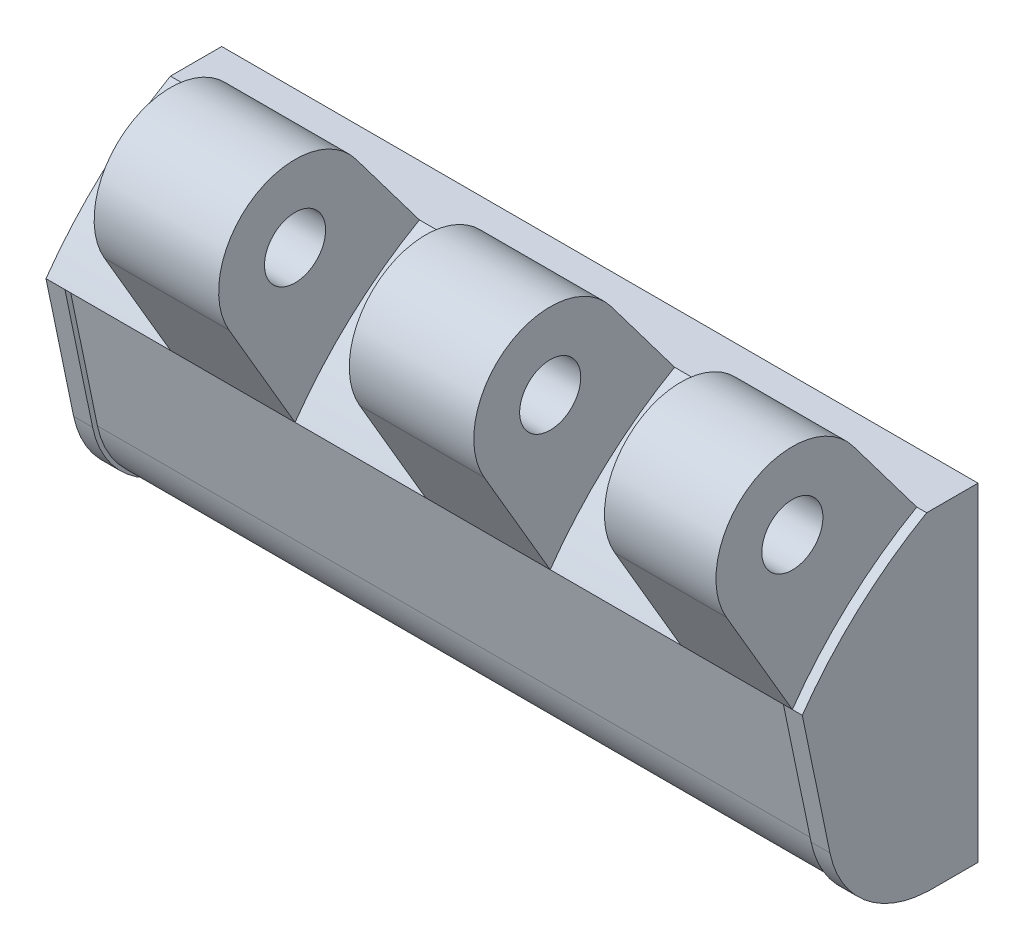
ISO-10303-21;
HEADER;
FILE_DESCRIPTION(('STEP AP214'),'2;1');
FILE_NAME('part.step','',(''),(''),'','','');
FILE_SCHEMA(('AUTOMOTIVE_DESIGN { 1 0 10303 214 1 1 1 1 }'));
ENDSEC;
DATA;
#1=APPLICATION_CONTEXT('core data for automotive mechanical design processes');
#2=APPLICATION_PROTOCOL_DEFINITION('international standard','automotive_design',2000,#1);
#3=PRODUCT_CONTEXT('',#1,'mechanical');
#4=PRODUCT('Part','Part','',(#3));
#5=PRODUCT_RELATED_PRODUCT_CATEGORY('part','',(#4));
#6=PRODUCT_DEFINITION_FORMATION('','',#4);
#7=PRODUCT_DEFINITION_CONTEXT('part definition',#1,'design');
#8=PRODUCT_DEFINITION('design','',#6,#7);
#9=PRODUCT_DEFINITION_SHAPE('','',#8);
#10=(LENGTH_UNIT() NAMED_UNIT(*) SI_UNIT(.MILLI.,.METRE.));
#11=(NAMED_UNIT(*) PLANE_ANGLE_UNIT() SI_UNIT($,.RADIAN.));
#12=(NAMED_UNIT(*) SI_UNIT($,.STERADIAN.) SOLID_ANGLE_UNIT());
#13=UNCERTAINTY_MEASURE_WITH_UNIT(LENGTH_MEASURE(1.E-05),#10,'distance_accuracy_value','');
#14=(GEOMETRIC_REPRESENTATION_CONTEXT(3) GLOBAL_UNCERTAINTY_ASSIGNED_CONTEXT((#13)) GLOBAL_UNIT_ASSIGNED_CONTEXT((#10,
#11,#12)) REPRESENTATION_CONTEXT('',''));
#15=CARTESIAN_POINT('',(0.,0.,0.));
#16=DIRECTION('',(0.,0.,1.));
#17=DIRECTION('',(1.,0.,0.));
#18=AXIS2_PLACEMENT_3D('',#15,#16,#17);
#19=CARTESIAN_POINT('',(38.63875,-1.75,3.09));
#20=DIRECTION('',(1.,0.,0.));
#21=DIRECTION('',(0.,1.,0.));
#22=AXIS2_PLACEMENT_3D('',#19,#20,#21);
#23=CYLINDRICAL_SURFACE('',#22,5.54);
#24=DIRECTION('',(1.,0.,0.));
#25=VECTOR('',#24,1.);
#26=CARTESIAN_POINT('',(2.4537386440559,-4.25,8.03384465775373));
#27=LINE('',#26,#25);
#28=CARTESIAN_POINT('',(2.4537386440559,-4.25,8.03384465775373));
#29=VERTEX_POINT('',#28);
#30=CARTESIAN_POINT('',(-2.45373864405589,-4.25,8.03384465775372));
#31=VERTEX_POINT('',#30);
#32=EDGE_CURVE('E448',#29,#31,#27,.F.);
#33=ORIENTED_EDGE('',*,*,#32,.T.);
#34=CARTESIAN_POINT('',(-3.89711431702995,-1.75,3.09));
#35=DIRECTION('',(-0.866025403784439,-0.5,0.));
#36=DIRECTION('',(0.5,-0.866025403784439,0.));
#37=AXIS2_PLACEMENT_3D('',#34,#35,#36);
#38=ELLIPSE('',#37,6.39704098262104,5.54);
#39=CARTESIAN_POINT('',(-3.24629054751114,-2.8772598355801,8.51410225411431));
#40=VERTEX_POINT('',#39);
#41=EDGE_CURVE('E386',#31,#40,#38,.T.);
#42=ORIENTED_EDGE('',*,*,#41,.T.);
#43=DIRECTION('',(1.,0.,0.));
#44=VECTOR('',#43,1.);
#45=CARTESIAN_POINT('',(38.63875,-2.8772598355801,8.51410225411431));
#46=LINE('',#45,#44);
#47=CARTESIAN_POINT('',(3.2462905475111,-2.8772598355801,8.51410225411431));
#48=VERTEX_POINT('',#47);
#49=EDGE_CURVE('E376',#48,#40,#46,.F.);
#50=ORIENTED_EDGE('',*,*,#49,.F.);
#51=CARTESIAN_POINT('',(3.89711431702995,-1.75,3.09));
#52=DIRECTION('',(0.866025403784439,-0.5,0.));
#53=DIRECTION('',(0.5,0.866025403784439,0.));
#54=AXIS2_PLACEMENT_3D('',#51,#52,#53);
#55=ELLIPSE('',#54,6.39704098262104,5.54);
#56=EDGE_CURVE('E450',#48,#29,#55,.T.);
#57=ORIENTED_EDGE('',*,*,#56,.T.);
#58=EDGE_LOOP('',(#33,#42,#50,#57));
#59=FACE_BOUND('',#58,.T.);
#60=ADVANCED_FACE('F14',(#59),#23,.F.);
#61=CARTESIAN_POINT('',(38.63875,-2.8772598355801,8.51410225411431));
#62=DIRECTION('',(0.,0.203476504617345,-0.979079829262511));
#63=DIRECTION('',(0.,0.979079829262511,0.203476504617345));
#64=AXIS2_PLACEMENT_3D('',#61,#62,#63);
#65=PLANE('',#64);
#66=DIRECTION('',(-1.,0.,0.));
#67=VECTOR('',#66,1.);
#68=CARTESIAN_POINT('',(-2.45373864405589,4.25,9.99531949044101));
#69=LINE('',#68,#67);
#70=CARTESIAN_POINT('',(-2.45373864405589,4.25,9.99531949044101));
#71=VERTEX_POINT('',#70);
#72=CARTESIAN_POINT('',(2.4537386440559,4.25,9.99531949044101));
#73=VERTEX_POINT('',#72);
#74=EDGE_CURVE('E476',#71,#73,#69,.F.);
#75=ORIENTED_EDGE('',*,*,#74,.T.);
#76=DIRECTION('',(0.49209328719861,-0.852330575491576,-0.177134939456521));
#77=VECTOR('',#76,1.);
#78=CARTESIAN_POINT('',(2.4537386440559,4.25,9.99531949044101));
#79=LINE('',#78,#77);
#80=CARTESIAN_POINT('',(4.9074772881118,0.,9.11206654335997));
#81=VERTEX_POINT('',#80);
#82=EDGE_CURVE('E495',#73,#81,#79,.T.);
#83=ORIENTED_EDGE('',*,*,#82,.T.);
#84=DIRECTION('',(-0.49209328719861,-0.852330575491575,-0.177134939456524));
#85=VECTOR('',#84,1.);
#86=CARTESIAN_POINT('',(4.9074772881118,0.,9.11206654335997));
#87=LINE('',#86,#85);
#88=EDGE_CURVE('E508',#81,#48,#87,.T.);
#89=ORIENTED_EDGE('',*,*,#88,.T.);
#90=ORIENTED_EDGE('',*,*,#49,.T.);
#91=DIRECTION('',(-0.49209328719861,0.852330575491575,0.177134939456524));
#92=VECTOR('',#91,1.);
#93=CARTESIAN_POINT('',(-3.24629054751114,-2.87725983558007,8.51410225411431));
#94=LINE('',#93,#92);
#95=CARTESIAN_POINT('',(-4.90747728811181,0.,9.11206654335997));
#96=VERTEX_POINT('',#95);
#97=EDGE_CURVE('E466',#40,#96,#94,.T.);
#98=ORIENTED_EDGE('',*,*,#97,.T.);
#99=DIRECTION('',(0.49209328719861,0.852330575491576,0.177134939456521));
#100=VECTOR('',#99,1.);
#101=CARTESIAN_POINT('',(-4.90747728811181,0.,9.11206654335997));
#102=LINE('',#101,#100);
#103=EDGE_CURVE('E463',#96,#71,#102,.T.);
#104=ORIENTED_EDGE('',*,*,#103,.T.);
#105=EDGE_LOOP('',(#75,#83,#89,#90,#98,#104));
#106=FACE_BOUND('',#105,.T.);
#107=ADVANCED_FACE('F16',(#106),#65,.T.);
#108=CARTESIAN_POINT('',(38.63875,-1.75,3.09));
#109=DIRECTION('',(1.,0.,0.));
#110=DIRECTION('',(0.,1.,0.));
#111=AXIS2_PLACEMENT_3D('',#108,#109,#110);
#112=CYLINDRICAL_SURFACE('',#111,5.54);
#113=DIRECTION('',(1.,0.,0.));
#114=VECTOR('',#113,1.);
#115=CARTESIAN_POINT('',(38.63875,-2.8772598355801,8.51410225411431));
#116=LINE('',#115,#114);
#117=CARTESIAN_POINT('',(33.7462905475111,-2.8772598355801,8.51410225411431));
#118=VERTEX_POINT('',#117);
#119=CARTESIAN_POINT('',(27.2537094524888,-2.8772598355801,8.51410225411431));
#120=VERTEX_POINT('',#119);
#121=EDGE_CURVE('E373',#118,#120,#116,.F.);
#122=ORIENTED_EDGE('',*,*,#121,.F.);
#123=CARTESIAN_POINT('',(34.3971143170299,-1.75,3.09));
#124=DIRECTION('',(0.866025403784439,-0.5,0.));
#125=DIRECTION('',(0.5,0.866025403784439,0.));
#126=AXIS2_PLACEMENT_3D('',#123,#124,#125);
#127=ELLIPSE('',#126,6.39704098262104,5.54);
#128=CARTESIAN_POINT('',(32.9537386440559,-4.25,8.03384465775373));
#129=VERTEX_POINT('',#128);
#130=EDGE_CURVE('E385',#118,#129,#127,.T.);
#131=ORIENTED_EDGE('',*,*,#130,.T.);
#132=DIRECTION('',(1.,0.,0.));
#133=VECTOR('',#132,1.);
#134=CARTESIAN_POINT('',(32.9537386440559,-4.25,8.03384465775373));
#135=LINE('',#134,#133);
#136=CARTESIAN_POINT('',(28.0462613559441,-4.25,8.03384465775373));
#137=VERTEX_POINT('',#136);
#138=EDGE_CURVE('E383',#129,#137,#135,.F.);
#139=ORIENTED_EDGE('',*,*,#138,.T.);
#140=CARTESIAN_POINT('',(26.6028856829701,-1.75,3.09));
#141=DIRECTION('',(-0.866025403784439,-0.5,0.));
#142=DIRECTION('',(0.5,-0.866025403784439,0.));
#143=AXIS2_PLACEMENT_3D('',#140,#141,#142);
#144=ELLIPSE('',#143,6.39704098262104,5.54);
#145=EDGE_CURVE('E620',#137,#120,#144,.T.);
#146=ORIENTED_EDGE('',*,*,#145,.T.);
#147=EDGE_LOOP('',(#122,#131,#139,#146));
#148=FACE_BOUND('',#147,.T.);
#149=ADVANCED_FACE('F750',(#148),#112,.F.);
#150=CARTESIAN_POINT('',(38.63875,-2.8772598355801,8.51410225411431));
#151=DIRECTION('',(0.,0.203476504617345,-0.979079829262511));
#152=DIRECTION('',(0.,0.979079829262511,0.203476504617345));
#153=AXIS2_PLACEMENT_3D('',#150,#151,#152);
#154=PLANE('',#153);
#155=DIRECTION('',(-0.49209328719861,-0.852330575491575,-0.177134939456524));
#156=VECTOR('',#155,1.);
#157=CARTESIAN_POINT('',(35.4074772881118,0.,9.11206654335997));
#158=LINE('',#157,#156);
#159=CARTESIAN_POINT('',(35.4074772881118,0.,9.11206654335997));
#160=VERTEX_POINT('',#159);
#161=EDGE_CURVE('E439',#160,#118,#158,.T.);
#162=ORIENTED_EDGE('',*,*,#161,.T.);
#163=ORIENTED_EDGE('',*,*,#121,.T.);
#164=DIRECTION('',(-0.492093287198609,0.852330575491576,0.177134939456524));
#165=VECTOR('',#164,1.);
#166=CARTESIAN_POINT('',(27.2537094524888,-2.87725983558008,8.51410225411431));
#167=LINE('',#166,#165);
#168=CARTESIAN_POINT('',(25.5925227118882,0.,9.11206654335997));
#169=VERTEX_POINT('',#168);
#170=EDGE_CURVE('E622',#120,#169,#167,.T.);
#171=ORIENTED_EDGE('',*,*,#170,.T.);
#172=DIRECTION('',(0.49209328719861,0.852330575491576,0.177134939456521));
#173=VECTOR('',#172,1.);
#174=CARTESIAN_POINT('',(25.5925227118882,0.,9.11206654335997));
#175=LINE('',#174,#173);
#176=CARTESIAN_POINT('',(28.0462613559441,4.25,9.99531949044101));
#177=VERTEX_POINT('',#176);
#178=EDGE_CURVE('E380',#169,#177,#175,.T.);
#179=ORIENTED_EDGE('',*,*,#178,.T.);
#180=DIRECTION('',(-1.,0.,0.));
#181=VECTOR('',#180,1.);
#182=CARTESIAN_POINT('',(28.0462613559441,4.25,9.99531949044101));
#183=LINE('',#182,#181);
#184=CARTESIAN_POINT('',(32.9537386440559,4.25,9.99531949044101));
#185=VERTEX_POINT('',#184);
#186=EDGE_CURVE('E412',#177,#185,#183,.F.);
#187=ORIENTED_EDGE('',*,*,#186,.T.);
#188=DIRECTION('',(0.49209328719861,-0.852330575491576,-0.177134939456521));
#189=VECTOR('',#188,1.);
#190=CARTESIAN_POINT('',(32.9537386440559,4.25,9.99531949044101));
#191=LINE('',#190,#189);
#192=EDGE_CURVE('E426',#185,#160,#191,.T.);
#193=ORIENTED_EDGE('',*,*,#192,.T.);
#194=EDGE_LOOP('',(#162,#163,#171,#179,#187,#193));
#195=FACE_BOUND('',#194,.T.);
#196=ADVANCED_FACE('F754',(#195),#154,.T.);
#197=CARTESIAN_POINT('',(-2.45373864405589,4.25,2.2));
#198=DIRECTION('',(0.,1.,0.));
#199=DIRECTION('',(-1.,0.,0.));
#200=AXIS2_PLACEMENT_3D('',#197,#198,#199);
#201=PLANE('',#200);
#202=DIRECTION('',(0.,0.,1.));
#203=VECTOR('',#202,1.);
#204=CARTESIAN_POINT('',(-2.45373864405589,4.25,2.2));
#205=LINE('',#204,#203);
#206=CARTESIAN_POINT('',(-2.45373864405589,4.25,2.2));
#207=VERTEX_POINT('',#206);
#208=EDGE_CURVE('E467',#71,#207,#205,.F.);
#209=ORIENTED_EDGE('',*,*,#208,.T.);
#210=DIRECTION('',(1.,0.,0.));
#211=VECTOR('',#210,1.);
#212=CARTESIAN_POINT('',(15.25,4.25,2.2));
#213=LINE('',#212,#211);
#214=CARTESIAN_POINT('',(2.4537386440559,4.25,2.2));
#215=VERTEX_POINT('',#214);
#216=EDGE_CURVE('E486',#215,#207,#213,.F.);
#217=ORIENTED_EDGE('',*,*,#216,.F.);
#218=DIRECTION('',(0.,0.,1.));
#219=VECTOR('',#218,1.);
#220=CARTESIAN_POINT('',(2.4537386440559,4.25,2.2));
#221=LINE('',#220,#219);
#222=EDGE_CURVE('E481',#73,#215,#221,.F.);
#223=ORIENTED_EDGE('',*,*,#222,.F.);
#224=ORIENTED_EDGE('',*,*,#74,.F.);
#225=EDGE_LOOP('',(#209,#217,#223,#224));
#226=FACE_BOUND('',#225,.T.);
#227=ADVANCED_FACE('F726',(#226),#201,.F.);
#228=CARTESIAN_POINT('',(2.4537386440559,4.25,2.2));
#229=DIRECTION('',(0.866025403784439,0.5,0.));
#230=DIRECTION('',(-0.5,0.866025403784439,0.));
#231=AXIS2_PLACEMENT_3D('',#228,#229,#230);
#232=PLANE('',#231);
#233=ORIENTED_EDGE('',*,*,#222,.T.);
#234=DIRECTION('',(-0.5,0.86602540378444,0.));
#235=VECTOR('',#234,1.);
#236=CARTESIAN_POINT('',(4.9074772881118,0.,2.2));
#237=LINE('',#236,#235);
#238=CARTESIAN_POINT('',(4.9074772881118,0.,2.2));
#239=VERTEX_POINT('',#238);
#240=EDGE_CURVE('E491',#239,#215,#237,.T.);
#241=ORIENTED_EDGE('',*,*,#240,.F.);
#242=DIRECTION('',(0.,0.,1.));
#243=VECTOR('',#242,1.);
#244=CARTESIAN_POINT('',(4.9074772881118,0.,2.2));
#245=LINE('',#244,#243);
#246=EDGE_CURVE('E500',#81,#239,#245,.F.);
#247=ORIENTED_EDGE('',*,*,#246,.F.);
#248=ORIENTED_EDGE('',*,*,#82,.F.);
#249=EDGE_LOOP('',(#233,#241,#247,#248));
#250=FACE_BOUND('',#249,.T.);
#251=ADVANCED_FACE('F723',(#250),#232,.F.);
#252=CARTESIAN_POINT('',(4.9074772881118,0.,2.2));
#253=DIRECTION('',(0.866025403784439,-0.5,0.));
#254=DIRECTION('',(0.5,0.866025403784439,0.));
#255=AXIS2_PLACEMENT_3D('',#252,#253,#254);
#256=PLANE('',#255);
#257=ORIENTED_EDGE('',*,*,#246,.T.);
#258=DIRECTION('',(0.5,0.86602540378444,0.));
#259=VECTOR('',#258,1.);
#260=CARTESIAN_POINT('',(2.4537386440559,-4.25,2.2));
#261=LINE('',#260,#259);
#262=CARTESIAN_POINT('',(2.4537386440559,-4.25,2.2));
#263=VERTEX_POINT('',#262);
#264=EDGE_CURVE('E454',#263,#239,#261,.T.);
#265=ORIENTED_EDGE('',*,*,#264,.F.);
#266=DIRECTION('',(0.,0.,1.));
#267=VECTOR('',#266,1.);
#268=CARTESIAN_POINT('',(2.4537386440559,-4.25,2.2));
#269=LINE('',#268,#267);
#270=EDGE_CURVE('E627',#29,#263,#269,.F.);
#271=ORIENTED_EDGE('',*,*,#270,.F.);
#272=ORIENTED_EDGE('',*,*,#56,.F.);
#273=ORIENTED_EDGE('',*,*,#88,.F.);
#274=EDGE_LOOP('',(#257,#265,#271,#272,#273));
#275=FACE_BOUND('',#274,.T.);
#276=ADVANCED_FACE('F706',(#275),#256,.F.);
#277=CARTESIAN_POINT('',(2.4537386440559,-4.25,2.2));
#278=DIRECTION('',(0.,-1.,0.));
#279=DIRECTION('',(1.,0.,0.));
#280=AXIS2_PLACEMENT_3D('',#277,#278,#279);
#281=PLANE('',#280);
#282=ORIENTED_EDGE('',*,*,#270,.T.);
#283=DIRECTION('',(1.,0.,0.));
#284=VECTOR('',#283,1.);
#285=CARTESIAN_POINT('',(15.25,-4.25,2.2));
#286=LINE('',#285,#284);
#287=CARTESIAN_POINT('',(-2.45373864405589,-4.25,2.2));
#288=VERTEX_POINT('',#287);
#289=EDGE_CURVE('E451',#288,#263,#286,.T.);
#290=ORIENTED_EDGE('',*,*,#289,.F.);
#291=DIRECTION('',(0.,0.,1.));
#292=VECTOR('',#291,1.);
#293=CARTESIAN_POINT('',(-2.45373864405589,-4.25,2.2));
#294=LINE('',#293,#292);
#295=EDGE_CURVE('E472',#288,#31,#294,.T.);
#296=ORIENTED_EDGE('',*,*,#295,.T.);
#297=ORIENTED_EDGE('',*,*,#32,.F.);
#298=EDGE_LOOP('',(#282,#290,#296,#297));
#299=FACE_BOUND('',#298,.T.);
#300=ADVANCED_FACE('F702',(#299),#281,.F.);
#301=CARTESIAN_POINT('',(-2.45373864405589,-4.25,2.2));
#302=DIRECTION('',(-0.866025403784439,-0.5,0.));
#303=DIRECTION('',(0.5,-0.866025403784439,0.));
#304=AXIS2_PLACEMENT_3D('',#301,#302,#303);
#305=PLANE('',#304);
#306=ORIENTED_EDGE('',*,*,#295,.F.);
#307=DIRECTION('',(0.5,-0.86602540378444,0.));
#308=VECTOR('',#307,1.);
#309=CARTESIAN_POINT('',(-4.90747728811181,0.,2.2));
#310=LINE('',#309,#308);
#311=CARTESIAN_POINT('',(-4.90747728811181,0.,2.2));
#312=VERTEX_POINT('',#311);
#313=EDGE_CURVE('E391',#312,#288,#310,.T.);
#314=ORIENTED_EDGE('',*,*,#313,.F.);
#315=DIRECTION('',(0.,0.,1.));
#316=VECTOR('',#315,1.);
#317=CARTESIAN_POINT('',(-4.90747728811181,0.,2.2));
#318=LINE('',#317,#316);
#319=EDGE_CURVE('E470',#96,#312,#318,.F.);
#320=ORIENTED_EDGE('',*,*,#319,.F.);
#321=ORIENTED_EDGE('',*,*,#97,.F.);
#322=ORIENTED_EDGE('',*,*,#41,.F.);
#323=EDGE_LOOP('',(#306,#314,#320,#321,#322));
#324=FACE_BOUND('',#323,.T.);
#325=ADVANCED_FACE('F716',(#324),#305,.F.);
#326=CARTESIAN_POINT('',(-4.90747728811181,0.,2.2));
#327=DIRECTION('',(-0.866025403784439,0.5,0.));
#328=DIRECTION('',(-0.5,-0.866025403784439,0.));
#329=AXIS2_PLACEMENT_3D('',#326,#327,#328);
#330=PLANE('',#329);
#331=ORIENTED_EDGE('',*,*,#319,.T.);
#332=DIRECTION('',(-0.5,-0.86602540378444,0.));
#333=VECTOR('',#332,1.);
#334=CARTESIAN_POINT('',(-2.45373864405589,4.25,2.2));
#335=LINE('',#334,#333);
#336=EDGE_CURVE('E460',#207,#312,#335,.T.);
#337=ORIENTED_EDGE('',*,*,#336,.F.);
#338=ORIENTED_EDGE('',*,*,#208,.F.);
#339=ORIENTED_EDGE('',*,*,#103,.F.);
#340=EDGE_LOOP('',(#331,#337,#338,#339));
#341=FACE_BOUND('',#340,.T.);
#342=ADVANCED_FACE('F730',(#341),#330,.F.);
#343=CARTESIAN_POINT('',(28.0462613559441,4.25,2.2));
#344=DIRECTION('',(0.,1.,0.));
#345=DIRECTION('',(-1.,0.,0.));
#346=AXIS2_PLACEMENT_3D('',#343,#344,#345);
#347=PLANE('',#346);
#348=DIRECTION('',(0.,0.,1.));
#349=VECTOR('',#348,1.);
#350=CARTESIAN_POINT('',(28.0462613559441,4.25,2.2));
#351=LINE('',#350,#349);
#352=CARTESIAN_POINT('',(28.0462613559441,4.25,2.2));
#353=VERTEX_POINT('',#352);
#354=EDGE_CURVE('E403',#177,#353,#351,.F.);
#355=ORIENTED_EDGE('',*,*,#354,.T.);
#356=DIRECTION('',(1.,0.,0.));
#357=VECTOR('',#356,1.);
#358=CARTESIAN_POINT('',(15.25,4.25,2.2));
#359=LINE('',#358,#357);
#360=CARTESIAN_POINT('',(32.9537386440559,4.25,2.2));
#361=VERTEX_POINT('',#360);
#362=EDGE_CURVE('E408',#361,#353,#359,.F.);
#363=ORIENTED_EDGE('',*,*,#362,.F.);
#364=DIRECTION('',(0.,0.,1.));
#365=VECTOR('',#364,1.);
#366=CARTESIAN_POINT('',(32.9537386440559,4.25,2.2));
#367=LINE('',#366,#365);
#368=EDGE_CURVE('E417',#185,#361,#367,.F.);
#369=ORIENTED_EDGE('',*,*,#368,.F.);
#370=ORIENTED_EDGE('',*,*,#186,.F.);
#371=EDGE_LOOP('',(#355,#363,#369,#370));
#372=FACE_BOUND('',#371,.T.);
#373=ADVANCED_FACE('F732',(#372),#347,.F.);
#374=CARTESIAN_POINT('',(32.9537386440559,4.25,2.2));
#375=DIRECTION('',(0.866025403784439,0.5,0.));
#376=DIRECTION('',(-0.5,0.866025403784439,0.));
#377=AXIS2_PLACEMENT_3D('',#374,#375,#376);
#378=PLANE('',#377);
#379=ORIENTED_EDGE('',*,*,#368,.T.);
#380=DIRECTION('',(-0.5,0.86602540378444,0.));
#381=VECTOR('',#380,1.);
#382=CARTESIAN_POINT('',(35.4074772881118,0.,2.2));
#383=LINE('',#382,#381);
#384=CARTESIAN_POINT('',(35.4074772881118,0.,2.2));
#385=VERTEX_POINT('',#384);
#386=EDGE_CURVE('E422',#385,#361,#383,.T.);
#387=ORIENTED_EDGE('',*,*,#386,.F.);
#388=DIRECTION('',(0.,0.,1.));
#389=VECTOR('',#388,1.);
#390=CARTESIAN_POINT('',(35.4074772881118,0.,2.2));
#391=LINE('',#390,#389);
#392=EDGE_CURVE('E431',#160,#385,#391,.F.);
#393=ORIENTED_EDGE('',*,*,#392,.F.);
#394=ORIENTED_EDGE('',*,*,#192,.F.);
#395=EDGE_LOOP('',(#379,#387,#393,#394));
#396=FACE_BOUND('',#395,.T.);
#397=ADVANCED_FACE('F740',(#396),#378,.F.);
#398=CARTESIAN_POINT('',(35.4074772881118,0.,2.2));
#399=DIRECTION('',(0.866025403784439,-0.5,0.));
#400=DIRECTION('',(0.5,0.866025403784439,0.));
#401=AXIS2_PLACEMENT_3D('',#398,#399,#400);
#402=PLANE('',#401);
#403=ORIENTED_EDGE('',*,*,#392,.T.);
#404=DIRECTION('',(0.5,0.86602540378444,0.));
#405=VECTOR('',#404,1.);
#406=CARTESIAN_POINT('',(32.9537386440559,-4.25,2.2));
#407=LINE('',#406,#405);
#408=CARTESIAN_POINT('',(32.9537386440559,-4.25,2.2));
#409=VERTEX_POINT('',#408);
#410=EDGE_CURVE('E390',#409,#385,#407,.T.);
#411=ORIENTED_EDGE('',*,*,#410,.F.);
#412=DIRECTION('',(0.,0.,1.));
#413=VECTOR('',#412,1.);
#414=CARTESIAN_POINT('',(32.9537386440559,-4.25,2.2));
#415=LINE('',#414,#413);
#416=EDGE_CURVE('E624',#129,#409,#415,.F.);
#417=ORIENTED_EDGE('',*,*,#416,.F.);
#418=ORIENTED_EDGE('',*,*,#130,.F.);
#419=ORIENTED_EDGE('',*,*,#161,.F.);
#420=EDGE_LOOP('',(#403,#411,#417,#418,#419));
#421=FACE_BOUND('',#420,.T.);
#422=ADVANCED_FACE('F1211',(#421),#402,.F.);
#423=CARTESIAN_POINT('',(32.9537386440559,-4.25,2.2));
#424=DIRECTION('',(0.,-1.,0.));
#425=DIRECTION('',(1.,0.,0.));
#426=AXIS2_PLACEMENT_3D('',#423,#424,#425);
#427=PLANE('',#426);
#428=ORIENTED_EDGE('',*,*,#416,.T.);
#429=DIRECTION('',(1.,0.,0.));
#430=VECTOR('',#429,1.);
#431=CARTESIAN_POINT('',(15.25,-4.25,2.2));
#432=LINE('',#431,#430);
#433=CARTESIAN_POINT('',(28.0462613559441,-4.25,2.2));
#434=VERTEX_POINT('',#433);
#435=EDGE_CURVE('E387',#434,#409,#432,.T.);
#436=ORIENTED_EDGE('',*,*,#435,.F.);
#437=DIRECTION('',(0.,0.,1.));
#438=VECTOR('',#437,1.);
#439=CARTESIAN_POINT('',(28.0462613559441,-4.25,2.2));
#440=LINE('',#439,#438);
#441=EDGE_CURVE('E379',#434,#137,#440,.T.);
#442=ORIENTED_EDGE('',*,*,#441,.T.);
#443=ORIENTED_EDGE('',*,*,#138,.F.);
#444=EDGE_LOOP('',(#428,#436,#442,#443));
#445=FACE_BOUND('',#444,.T.);
#446=ADVANCED_FACE('F1204',(#445),#427,.F.);
#447=CARTESIAN_POINT('',(28.0462613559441,-4.25,2.2));
#448=DIRECTION('',(-0.866025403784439,-0.5,0.));
#449=DIRECTION('',(0.5,-0.866025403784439,0.));
#450=AXIS2_PLACEMENT_3D('',#447,#448,#449);
#451=PLANE('',#450);
#452=ORIENTED_EDGE('',*,*,#145,.F.);
#453=ORIENTED_EDGE('',*,*,#441,.F.);
#454=DIRECTION('',(0.5,-0.86602540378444,0.));
#455=VECTOR('',#454,1.);
#456=CARTESIAN_POINT('',(25.5925227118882,0.,2.2));
#457=LINE('',#456,#455);
#458=CARTESIAN_POINT('',(25.5925227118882,0.,2.2));
#459=VERTEX_POINT('',#458);
#460=EDGE_CURVE('E394',#459,#434,#457,.T.);
#461=ORIENTED_EDGE('',*,*,#460,.F.);
#462=DIRECTION('',(0.,0.,1.));
#463=VECTOR('',#462,1.);
#464=CARTESIAN_POINT('',(25.5925227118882,0.,2.2));
#465=LINE('',#464,#463);
#466=EDGE_CURVE('E377',#169,#459,#465,.F.);
#467=ORIENTED_EDGE('',*,*,#466,.F.);
#468=ORIENTED_EDGE('',*,*,#170,.F.);
#469=EDGE_LOOP('',(#452,#453,#461,#467,#468));
#470=FACE_BOUND('',#469,.T.);
#471=ADVANCED_FACE('F1201',(#470),#451,.F.);
#472=CARTESIAN_POINT('',(25.5925227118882,0.,2.2));
#473=DIRECTION('',(-0.866025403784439,0.5,0.));
#474=DIRECTION('',(-0.5,-0.866025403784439,0.));
#475=AXIS2_PLACEMENT_3D('',#472,#473,#474);
#476=PLANE('',#475);
#477=ORIENTED_EDGE('',*,*,#466,.T.);
#478=DIRECTION('',(-0.5,-0.86602540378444,0.));
#479=VECTOR('',#478,1.);
#480=CARTESIAN_POINT('',(28.0462613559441,4.25,2.2));
#481=LINE('',#480,#479);
#482=EDGE_CURVE('E398',#353,#459,#481,.T.);
#483=ORIENTED_EDGE('',*,*,#482,.F.);
#484=ORIENTED_EDGE('',*,*,#354,.F.);
#485=ORIENTED_EDGE('',*,*,#178,.F.);
#486=EDGE_LOOP('',(#477,#483,#484,#485));
#487=FACE_BOUND('',#486,.T.);
#488=ADVANCED_FACE('F1195',(#487),#476,.F.);
#489=CARTESIAN_POINT('',(15.25,15.5,2.2));
#490=DIRECTION('',(0.,0.,1.));
#491=DIRECTION('',(1.,0.,0.));
#492=AXIS2_PLACEMENT_3D('',#489,#490,#491);
#493=PLANE('',#492);
#494=ORIENTED_EDGE('',*,*,#336,.T.);
#495=ORIENTED_EDGE('',*,*,#313,.T.);
#496=ORIENTED_EDGE('',*,*,#289,.T.);
#497=ORIENTED_EDGE('',*,*,#264,.T.);
#498=ORIENTED_EDGE('',*,*,#240,.T.);
#499=ORIENTED_EDGE('',*,*,#216,.T.);
#500=EDGE_LOOP('',(#494,#495,#496,#497,#498,#499));
#501=FACE_BOUND('',#500,.T.);
#502=CARTESIAN_POINT('',(0.,0.,2.2));
#503=DIRECTION('',(0.,0.,1.));
#504=DIRECTION('',(1.,0.,0.));
#505=AXIS2_PLACEMENT_3D('',#502,#503,#504);
#506=CIRCLE('',#505,2.75);
#507=CARTESIAN_POINT('',(2.75,0.,2.2));
#508=VERTEX_POINT('',#507);
#509=EDGE_CURVE('E550',#508,#508,#506,.F.);
#510=ORIENTED_EDGE('',*,*,#509,.T.);
#511=EDGE_LOOP('',(#510));
#512=FACE_BOUND('',#511,.T.);
#513=ADVANCED_FACE('F710',(#501,#512),#493,.T.);
#514=CARTESIAN_POINT('',(15.25,15.5,2.2));
#515=DIRECTION('',(0.,0.,1.));
#516=DIRECTION('',(1.,0.,0.));
#517=AXIS2_PLACEMENT_3D('',#514,#515,#516);
#518=PLANE('',#517);
#519=ORIENTED_EDGE('',*,*,#482,.T.);
#520=ORIENTED_EDGE('',*,*,#460,.T.);
#521=ORIENTED_EDGE('',*,*,#435,.T.);
#522=ORIENTED_EDGE('',*,*,#410,.T.);
#523=ORIENTED_EDGE('',*,*,#386,.T.);
#524=ORIENTED_EDGE('',*,*,#362,.T.);
#525=EDGE_LOOP('',(#519,#520,#521,#522,#523,#524));
#526=FACE_BOUND('',#525,.T.);
#527=CARTESIAN_POINT('',(30.5,0.,2.2));
#528=DIRECTION('',(0.,0.,1.));
#529=DIRECTION('',(1.,0.,0.));
#530=AXIS2_PLACEMENT_3D('',#527,#528,#529);
#531=CIRCLE('',#530,2.75);
#532=CARTESIAN_POINT('',(33.25,0.,2.2));
#533=VERTEX_POINT('',#532);
#534=EDGE_CURVE('E547',#533,#533,#531,.F.);
#535=ORIENTED_EDGE('',*,*,#534,.T.);
#536=EDGE_LOOP('',(#535));
#537=FACE_BOUND('',#536,.T.);
#538=ADVANCED_FACE('F1181',(#526,#537),#518,.T.);
#539=CARTESIAN_POINT('',(0.,0.,2.2));
#540=DIRECTION('',(0.,0.,1.));
#541=DIRECTION('',(1.,0.,0.));
#542=AXIS2_PLACEMENT_3D('',#539,#540,#541);
#543=CYLINDRICAL_SURFACE('',#542,2.75);
#544=ORIENTED_EDGE('',*,*,#509,.F.);
#545=EDGE_LOOP('',(#544));
#546=FACE_BOUND('',#545,.T.);
#547=CARTESIAN_POINT('',(0.,0.,0.));
#548=DIRECTION('',(0.,0.,1.));
#549=DIRECTION('',(1.,0.,0.));
#550=AXIS2_PLACEMENT_3D('',#547,#548,#549);
#551=CIRCLE('',#550,2.75);
#552=CARTESIAN_POINT('',(2.75,0.,0.));
#553=VERTEX_POINT('',#552);
#554=EDGE_CURVE('E527',#553,#553,#551,.T.);
#555=ORIENTED_EDGE('',*,*,#554,.F.);
#556=EDGE_LOOP('',(#555));
#557=FACE_BOUND('',#556,.T.);
#558=ADVANCED_FACE('F1177',(#546,#557),#543,.F.);
#559=CARTESIAN_POINT('',(30.5,0.,2.2));
#560=DIRECTION('',(0.,0.,1.));
#561=DIRECTION('',(1.,0.,0.));
#562=AXIS2_PLACEMENT_3D('',#559,#560,#561);
#563=CYLINDRICAL_SURFACE('',#562,2.75);
#564=ORIENTED_EDGE('',*,*,#534,.F.);
#565=EDGE_LOOP('',(#564));
#566=FACE_BOUND('',#565,.T.);
#567=CARTESIAN_POINT('',(30.5,0.,0.));
#568=DIRECTION('',(0.,0.,1.));
#569=DIRECTION('',(1.,0.,0.));
#570=AXIS2_PLACEMENT_3D('',#567,#568,#569);
#571=CIRCLE('',#570,2.75);
#572=CARTESIAN_POINT('',(33.25,0.,0.));
#573=VERTEX_POINT('',#572);
#574=EDGE_CURVE('E523',#573,#573,#571,.T.);
#575=ORIENTED_EDGE('',*,*,#574,.F.);
#576=EDGE_LOOP('',(#575));
#577=FACE_BOUND('',#576,.T.);
#578=ADVANCED_FACE('F762',(#566,#577),#563,.F.);
#579=CARTESIAN_POINT('',(38.7625,-1.75,3.09));
#580=DIRECTION('',(1.,0.,0.));
#581=DIRECTION('',(0.,1.,0.));
#582=AXIS2_PLACEMENT_3D('',#579,#580,#581);
#583=CYLINDRICAL_SURFACE('',#582,5.54);
#584=CARTESIAN_POINT('',(-8.2625,-1.75,3.09));
#585=DIRECTION('',(1.,0.,0.));
#586=DIRECTION('',(0.,1.,0.));
#587=AXIS2_PLACEMENT_3D('',#584,#585,#586);
#588=CIRCLE('',#587,5.54);
#589=CARTESIAN_POINT('',(-8.2625,-7.28345498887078,3.35921345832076));
#590=VERTEX_POINT('',#589);
#591=CARTESIAN_POINT('',(-8.2625,-2.8772598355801,8.51410225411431));
#592=VERTEX_POINT('',#591);
#593=EDGE_CURVE('E617',#590,#592,#588,.F.);
#594=ORIENTED_EDGE('',*,*,#593,.F.);
#595=DIRECTION('',(1.,0.,0.));
#596=VECTOR('',#595,1.);
#597=CARTESIAN_POINT('',(38.7625,-7.28345498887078,3.35921345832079));
#598=LINE('',#597,#596);
#599=CARTESIAN_POINT('',(-8.13875,-7.28345498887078,3.35921345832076));
#600=VERTEX_POINT('',#599);
#601=EDGE_CURVE('E316',#590,#600,#598,.T.);
#602=ORIENTED_EDGE('',*,*,#601,.T.);
#603=CARTESIAN_POINT('',(-8.13875,-1.75,3.09));
#604=DIRECTION('',(1.,0.,0.));
#605=DIRECTION('',(0.,1.,0.));
#606=AXIS2_PLACEMENT_3D('',#603,#604,#605);
#607=CIRCLE('',#606,5.54);
#608=CARTESIAN_POINT('',(-8.13875,-2.8772598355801,8.51410225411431));
#609=VERTEX_POINT('',#608);
#610=EDGE_CURVE('E18',#600,#609,#607,.F.);
#611=ORIENTED_EDGE('',*,*,#610,.T.);
#612=DIRECTION('',(1.,0.,0.));
#613=VECTOR('',#612,1.);
#614=CARTESIAN_POINT('',(38.7625,-2.8772598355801,8.51410225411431));
#615=LINE('',#614,#613);
#616=EDGE_CURVE('E304',#609,#592,#615,.F.);
#617=ORIENTED_EDGE('',*,*,#616,.T.);
#618=EDGE_LOOP('',(#594,#602,#611,#617));
#619=FACE_BOUND('',#618,.T.);
#620=ADVANCED_FACE('F319',(#619),#583,.T.);
#621=CARTESIAN_POINT('',(38.7625,-1.75,3.09));
#622=DIRECTION('',(1.,0.,0.));
#623=DIRECTION('',(0.,1.,0.));
#624=AXIS2_PLACEMENT_3D('',#621,#622,#623);
#625=CYLINDRICAL_SURFACE('',#624,5.54);
#626=CARTESIAN_POINT('',(38.7625,-1.75,3.09));
#627=DIRECTION('',(1.,0.,0.));
#628=DIRECTION('',(0.,1.,0.));
#629=AXIS2_PLACEMENT_3D('',#626,#627,#628);
#630=CIRCLE('',#629,5.54);
#631=CARTESIAN_POINT('',(38.7625,-7.28345498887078,3.35921345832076));
#632=VERTEX_POINT('',#631);
#633=CARTESIAN_POINT('',(38.7625,-2.8772598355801,8.51410225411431));
#634=VERTEX_POINT('',#633);
#635=EDGE_CURVE('E596',#632,#634,#630,.F.);
#636=ORIENTED_EDGE('',*,*,#635,.T.);
#637=DIRECTION('',(1.,0.,0.));
#638=VECTOR('',#637,1.);
#639=CARTESIAN_POINT('',(38.7625,-2.8772598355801,8.51410225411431));
#640=LINE('',#639,#638);
#641=CARTESIAN_POINT('',(38.63875,-2.8772598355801,8.51410225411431));
#642=VERTEX_POINT('',#641);
#643=EDGE_CURVE('E325',#634,#642,#640,.F.);
#644=ORIENTED_EDGE('',*,*,#643,.T.);
#645=CARTESIAN_POINT('',(38.63875,-1.75,3.09));
#646=DIRECTION('',(1.,0.,0.));
#647=DIRECTION('',(0.,1.,0.));
#648=AXIS2_PLACEMENT_3D('',#645,#646,#647);
#649=CIRCLE('',#648,5.54);
#650=CARTESIAN_POINT('',(38.63875,-7.28345498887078,3.35921345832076));
#651=VERTEX_POINT('',#650);
#652=EDGE_CURVE('E628',#651,#642,#649,.F.);
#653=ORIENTED_EDGE('',*,*,#652,.F.);
#654=DIRECTION('',(1.,0.,0.));
#655=VECTOR('',#654,1.);
#656=CARTESIAN_POINT('',(38.7625,-7.28345498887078,3.35921345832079));
#657=LINE('',#656,#655);
#658=EDGE_CURVE('E328',#651,#632,#657,.T.);
#659=ORIENTED_EDGE('',*,*,#658,.T.);
#660=EDGE_LOOP('',(#636,#644,#653,#659));
#661=FACE_BOUND('',#660,.T.);
#662=ADVANCED_FACE('F761',(#661),#625,.T.);
#663=CARTESIAN_POINT('',(38.63875,-1.75,3.09));
#664=DIRECTION('',(1.,0.,0.));
#665=DIRECTION('',(0.,1.,0.));
#666=AXIS2_PLACEMENT_3D('',#663,#664,#665);
#667=CYLINDRICAL_SURFACE('',#666,6.54);
#668=CARTESIAN_POINT('',(38.63875,-1.75,3.09));
#669=DIRECTION('',(1.,0.,0.));
#670=DIRECTION('',(0.,1.,0.));
#671=AXIS2_PLACEMENT_3D('',#668,#669,#670);
#672=CIRCLE('',#671,6.54);
#673=CARTESIAN_POINT('',(38.63875,-8.28445668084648,3.35921345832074));
#674=VERTEX_POINT('',#673);
#675=CARTESIAN_POINT('',(38.63875,-3.08073634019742,9.49318208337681));
#676=VERTEX_POINT('',#675);
#677=EDGE_CURVE('E589',#674,#676,#672,.F.);
#678=ORIENTED_EDGE('',*,*,#677,.T.);
#679=DIRECTION('',(1.,0.,0.));
#680=VECTOR('',#679,1.);
#681=CARTESIAN_POINT('',(38.63875,-3.08073634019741,9.49318208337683));
#682=LINE('',#681,#680);
#683=CARTESIAN_POINT('',(-8.13875,-3.08073634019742,9.49318208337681));
#684=VERTEX_POINT('',#683);
#685=EDGE_CURVE('E455',#676,#684,#682,.F.);
#686=ORIENTED_EDGE('',*,*,#685,.T.);
#687=CARTESIAN_POINT('',(-8.13875,-1.75,3.09));
#688=DIRECTION('',(1.,0.,0.));
#689=DIRECTION('',(0.,1.,0.));
#690=AXIS2_PLACEMENT_3D('',#687,#688,#689);
#691=CIRCLE('',#690,6.54);
#692=CARTESIAN_POINT('',(-8.13875,-8.28445668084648,3.35921345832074));
#693=VERTEX_POINT('',#692);
#694=EDGE_CURVE('E592',#684,#693,#691,.T.);
#695=ORIENTED_EDGE('',*,*,#694,.T.);
#696=DIRECTION('',(1.,0.,0.));
#697=VECTOR('',#696,1.);
#698=CARTESIAN_POINT('',(40.,-8.2844566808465,3.35921345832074));
#699=LINE('',#698,#697);
#700=EDGE_CURVE('E553',#674,#693,#699,.F.);
#701=ORIENTED_EDGE('',*,*,#700,.F.);
#702=EDGE_LOOP('',(#678,#686,#695,#701));
#703=FACE_BOUND('',#702,.T.);
#704=ADVANCED_FACE('F785',(#703),#667,.T.);
#705=CARTESIAN_POINT('',(40.,-1.75,3.09));
#706=DIRECTION('',(1.,0.,0.));
#707=DIRECTION('',(0.,1.,0.));
#708=AXIS2_PLACEMENT_3D('',#705,#706,#707);
#709=CYLINDRICAL_SURFACE('',#708,6.74);
#710=CARTESIAN_POINT('',(-9.5,-1.75,3.09));
#711=DIRECTION('',(1.,0.,0.));
#712=DIRECTION('',(0.,1.,0.));
#713=AXIS2_PLACEMENT_3D('',#710,#711,#712);
#714=CIRCLE('',#713,6.74);
#715=CARTESIAN_POINT('',(-9.5,-3.12143164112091,9.68899804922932));
#716=VERTEX_POINT('',#715);
#717=CARTESIAN_POINT('',(-9.5,-8.48462130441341,3.35921345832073));
#718=VERTEX_POINT('',#717);
#719=EDGE_CURVE('E540',#716,#718,#714,.T.);
#720=ORIENTED_EDGE('',*,*,#719,.T.);
#721=DIRECTION('',(1.,0.,0.));
#722=VECTOR('',#721,1.);
#723=CARTESIAN_POINT('',(40.,-8.4846213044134,3.35921345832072));
#724=LINE('',#723,#722);
#725=CARTESIAN_POINT('',(-8.2625,-8.48462130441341,3.35921345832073));
#726=VERTEX_POINT('',#725);
#727=EDGE_CURVE('E1460',#726,#718,#724,.F.);
#728=ORIENTED_EDGE('',*,*,#727,.F.);
#729=CARTESIAN_POINT('',(-8.2625,-1.75,3.09));
#730=DIRECTION('',(1.,0.,0.));
#731=DIRECTION('',(0.,1.,0.));
#732=AXIS2_PLACEMENT_3D('',#729,#730,#731);
#733=CIRCLE('',#732,6.74);
#734=CARTESIAN_POINT('',(-8.2625,-3.12143164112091,9.68899804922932));
#735=VERTEX_POINT('',#734);
#736=EDGE_CURVE('E586',#726,#735,#733,.F.);
#737=ORIENTED_EDGE('',*,*,#736,.T.);
#738=DIRECTION('',(1.,0.,0.));
#739=VECTOR('',#738,1.);
#740=CARTESIAN_POINT('',(40.,-3.1214316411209,9.68899804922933));
#741=LINE('',#740,#739);
#742=EDGE_CURVE('E585',#735,#716,#741,.F.);
#743=ORIENTED_EDGE('',*,*,#742,.T.);
#744=EDGE_LOOP('',(#720,#728,#737,#743));
#745=FACE_BOUND('',#744,.T.);
#746=ADVANCED_FACE('F1170',(#745),#709,.T.);
#747=CARTESIAN_POINT('',(40.,-8.5,0.));
#748=DIRECTION('',(0.,0.,-1.));
#749=DIRECTION('',(-1.,0.,0.));
#750=AXIS2_PLACEMENT_3D('',#747,#748,#749);
#751=PLANE('',#750);
#752=DIRECTION('',(0.,1.,0.));
#753=VECTOR('',#752,1.);
#754=CARTESIAN_POINT('',(40.,-8.5,0.));
#755=LINE('',#754,#753);
#756=CARTESIAN_POINT('',(40.,13.,0.));
#757=VERTEX_POINT('',#756);
#758=CARTESIAN_POINT('',(40.,-8.5,0.));
#759=VERTEX_POINT('',#758);
#760=EDGE_CURVE('E24',#757,#759,#755,.F.);
#761=ORIENTED_EDGE('',*,*,#760,.T.);
#762=DIRECTION('',(-1.,0.,0.));
#763=VECTOR('',#762,1.);
#764=CARTESIAN_POINT('',(40.,-8.5,0.));
#765=LINE('',#764,#763);
#766=CARTESIAN_POINT('',(-9.5,-8.5,0.));
#767=VERTEX_POINT('',#766);
#768=EDGE_CURVE('E9',#759,#767,#765,.T.);
#769=ORIENTED_EDGE('',*,*,#768,.T.);
#770=DIRECTION('',(0.,1.,0.));
#771=VECTOR('',#770,1.);
#772=CARTESIAN_POINT('',(-9.5,-8.5,0.));
#773=LINE('',#772,#771);
#774=CARTESIAN_POINT('',(-9.5,13.,0.));
#775=VERTEX_POINT('',#774);
#776=EDGE_CURVE('E526',#767,#775,#773,.T.);
#777=ORIENTED_EDGE('',*,*,#776,.T.);
#778=DIRECTION('',(-1.,0.,0.));
#779=VECTOR('',#778,1.);
#780=CARTESIAN_POINT('',(40.,13.,0.));
#781=LINE('',#780,#779);
#782=EDGE_CURVE('E1417',#775,#757,#781,.F.);
#783=ORIENTED_EDGE('',*,*,#782,.T.);
#784=EDGE_LOOP('',(#761,#769,#777,#783));
#785=FACE_BOUND('',#784,.T.);
#786=ORIENTED_EDGE('',*,*,#574,.T.);
#787=EDGE_LOOP('',(#786));
#788=FACE_BOUND('',#787,.T.);
#789=ORIENTED_EDGE('',*,*,#554,.T.);
#790=EDGE_LOOP('',(#789));
#791=FACE_BOUND('',#790,.T.);
#792=ADVANCED_FACE('F1166',(#785,#788,#791),#751,.T.);
#793=CARTESIAN_POINT('',(40.,-8.5,3.35921345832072));
#794=DIRECTION('',(0.,-1.,0.));
#795=DIRECTION('',(1.,0.,0.));
#796=AXIS2_PLACEMENT_3D('',#793,#794,#795);
#797=PLANE('',#796);
#798=DIRECTION('',(0.,0.,1.));
#799=VECTOR('',#798,1.);
#800=CARTESIAN_POINT('',(40.,-8.5,3.35921345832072));
#801=LINE('',#800,#799);
#802=CARTESIAN_POINT('',(40.,-8.5,3.35921345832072));
#803=VERTEX_POINT('',#802);
#804=EDGE_CURVE('E33',#759,#803,#801,.T.);
#805=ORIENTED_EDGE('',*,*,#804,.T.);
#806=DIRECTION('',(1.,0.,0.));
#807=VECTOR('',#806,1.);
#808=CARTESIAN_POINT('',(40.,-8.5,3.35921345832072));
#809=LINE('',#808,#807);
#810=CARTESIAN_POINT('',(-9.5,-8.5,3.35921345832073));
#811=VERTEX_POINT('',#810);
#812=EDGE_CURVE('E530',#803,#811,#809,.F.);
#813=ORIENTED_EDGE('',*,*,#812,.T.);
#814=DIRECTION('',(0.,0.,1.));
#815=VECTOR('',#814,1.);
#816=CARTESIAN_POINT('',(-9.5,-8.5,3.35921345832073));
#817=LINE('',#816,#815);
#818=EDGE_CURVE('E1463',#811,#767,#817,.F.);
#819=ORIENTED_EDGE('',*,*,#818,.T.);
#820=ORIENTED_EDGE('',*,*,#768,.F.);
#821=EDGE_LOOP('',(#805,#813,#819,#820));
#822=FACE_BOUND('',#821,.T.);
#823=ADVANCED_FACE('F1169',(#822),#797,.T.);
#824=CARTESIAN_POINT('',(40.,-8.4846213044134,3.35921345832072));
#825=DIRECTION('',(0.,0.,1.));
#826=DIRECTION('',(0.,-1.,0.));
#827=AXIS2_PLACEMENT_3D('',#824,#825,#826);
#828=PLANE('',#827);
#829=DIRECTION('',(0.,1.,0.));
#830=VECTOR('',#829,1.);
#831=CARTESIAN_POINT('',(38.63875,15.5,3.35921345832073));
#832=LINE('',#831,#830);
#833=EDGE_CURVE('E321',#674,#651,#832,.T.);
#834=ORIENTED_EDGE('',*,*,#833,.F.);
#835=ORIENTED_EDGE('',*,*,#700,.T.);
#836=DIRECTION('',(0.,1.,0.));
#837=VECTOR('',#836,1.);
#838=CARTESIAN_POINT('',(-8.13875,15.5,3.35921345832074));
#839=LINE('',#838,#837);
#840=EDGE_CURVE('E298',#693,#600,#839,.T.);
#841=ORIENTED_EDGE('',*,*,#840,.T.);
#842=ORIENTED_EDGE('',*,*,#601,.F.);
#843=DIRECTION('',(0.,1.,0.));
#844=VECTOR('',#843,1.);
#845=CARTESIAN_POINT('',(-8.2625,15.5,3.35921345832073));
#846=LINE('',#845,#844);
#847=EDGE_CURVE('E619',#726,#590,#846,.T.);
#848=ORIENTED_EDGE('',*,*,#847,.F.);
#849=ORIENTED_EDGE('',*,*,#727,.T.);
#850=DIRECTION('',(0.,1.,0.));
#851=VECTOR('',#850,1.);
#852=CARTESIAN_POINT('',(-9.5,15.5,3.35921345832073));
#853=LINE('',#852,#851);
#854=EDGE_CURVE('E542',#718,#811,#853,.F.);
#855=ORIENTED_EDGE('',*,*,#854,.T.);
#856=ORIENTED_EDGE('',*,*,#812,.F.);
#857=DIRECTION('',(0.,1.,0.));
#858=VECTOR('',#857,1.);
#859=CARTESIAN_POINT('',(40.,15.5,3.35921345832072));
#860=LINE('',#859,#858);
#861=CARTESIAN_POINT('',(40.,-8.48462130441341,3.35921345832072));
#862=VERTEX_POINT('',#861);
#863=EDGE_CURVE('E534',#862,#803,#860,.F.);
#864=ORIENTED_EDGE('',*,*,#863,.F.);
#865=DIRECTION('',(1.,0.,0.));
#866=VECTOR('',#865,1.);
#867=CARTESIAN_POINT('',(40.,-8.4846213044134,3.35921345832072));
#868=LINE('',#867,#866);
#869=CARTESIAN_POINT('',(38.7625,-8.48462130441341,3.35921345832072));
#870=VERTEX_POINT('',#869);
#871=EDGE_CURVE('E641',#862,#870,#868,.F.);
#872=ORIENTED_EDGE('',*,*,#871,.T.);
#873=DIRECTION('',(0.,1.,0.));
#874=VECTOR('',#873,1.);
#875=CARTESIAN_POINT('',(38.7625,15.5,3.35921345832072));
#876=LINE('',#875,#874);
#877=EDGE_CURVE('E599',#870,#632,#876,.T.);
#878=ORIENTED_EDGE('',*,*,#877,.T.);
#879=ORIENTED_EDGE('',*,*,#658,.F.);
#880=EDGE_LOOP('',(#834,#835,#841,#842,#848,#849,#855,#856,#864,#872,#878,#879));
#881=FACE_BOUND('',#880,.T.);
#882=ADVANCED_FACE('F1173',(#881),#828,.T.);
#883=CARTESIAN_POINT('',(40.,-1.75,3.09));
#884=DIRECTION('',(1.,0.,0.));
#885=DIRECTION('',(0.,1.,0.));
#886=AXIS2_PLACEMENT_3D('',#883,#884,#885);
#887=CYLINDRICAL_SURFACE('',#886,6.74);
#888=CARTESIAN_POINT('',(40.,-1.75,3.09));
#889=DIRECTION('',(1.,0.,0.));
#890=DIRECTION('',(0.,1.,0.));
#891=AXIS2_PLACEMENT_3D('',#888,#889,#890);
#892=CIRCLE('',#891,6.74);
#893=CARTESIAN_POINT('',(40.,-3.12143164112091,9.68899804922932));
#894=VERTEX_POINT('',#893);
#895=EDGE_CURVE('E531',#894,#862,#892,.T.);
#896=ORIENTED_EDGE('',*,*,#895,.F.);
#897=DIRECTION('',(1.,0.,0.));
#898=VECTOR('',#897,1.);
#899=CARTESIAN_POINT('',(40.,-3.1214316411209,9.68899804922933));
#900=LINE('',#899,#898);
#901=CARTESIAN_POINT('',(38.7625,-3.12143164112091,9.68899804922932));
#902=VERTEX_POINT('',#901);
#903=EDGE_CURVE('E557',#894,#902,#900,.F.);
#904=ORIENTED_EDGE('',*,*,#903,.T.);
#905=CARTESIAN_POINT('',(38.7625,-1.75,3.09));
#906=DIRECTION('',(1.,0.,0.));
#907=DIRECTION('',(0.,1.,0.));
#908=AXIS2_PLACEMENT_3D('',#905,#906,#907);
#909=CIRCLE('',#908,6.74);
#910=EDGE_CURVE('E554',#902,#870,#909,.T.);
#911=ORIENTED_EDGE('',*,*,#910,.T.);
#912=ORIENTED_EDGE('',*,*,#871,.F.);
#913=EDGE_LOOP('',(#896,#904,#911,#912));
#914=FACE_BOUND('',#913,.T.);
#915=ADVANCED_FACE('F795',(#914),#887,.T.);
#916=CARTESIAN_POINT('',(-8.13875,15.5,0.));
#917=DIRECTION('',(1.,0.,0.));
#918=DIRECTION('',(0.,1.,0.));
#919=AXIS2_PLACEMENT_3D('',#916,#917,#918);
#920=PLANE('',#919);
#921=ORIENTED_EDGE('',*,*,#840,.F.);
#922=ORIENTED_EDGE('',*,*,#694,.F.);
#923=DIRECTION('',(0.,-0.979079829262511,-0.203476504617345));
#924=VECTOR('',#923,1.);
#925=CARTESIAN_POINT('',(-8.13875,5.5926726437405,11.2957265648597));
#926=LINE('',#925,#924);
#927=CARTESIAN_POINT('',(-8.13875,5.5926726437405,11.2957265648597));
#928=VERTEX_POINT('',#927);
#929=EDGE_CURVE('E334',#928,#684,#926,.T.);
#930=ORIENTED_EDGE('',*,*,#929,.F.);
#931=DIRECTION('',(0.,0.,1.));
#932=VECTOR('',#931,1.);
#933=CARTESIAN_POINT('',(-8.13875,5.5926726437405,10.2743593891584));
#934=LINE('',#933,#932);
#935=CARTESIAN_POINT('',(-8.13875,5.5926726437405,10.2743593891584));
#936=VERTEX_POINT('',#935);
#937=EDGE_CURVE('E324',#928,#936,#934,.F.);
#938=ORIENTED_EDGE('',*,*,#937,.T.);
#939=DIRECTION('',(0.,0.979079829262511,0.203476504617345));
#940=VECTOR('',#939,1.);
#941=CARTESIAN_POINT('',(-8.13875,-2.8772598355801,8.51410225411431));
#942=LINE('',#941,#940);
#943=EDGE_CURVE('E308',#609,#936,#942,.T.);
#944=ORIENTED_EDGE('',*,*,#943,.F.);
#945=ORIENTED_EDGE('',*,*,#610,.F.);
#946=EDGE_LOOP('',(#921,#922,#930,#938,#944,#945));
#947=FACE_BOUND('',#946,.T.);
#948=ADVANCED_FACE('F322',(#947),#920,.F.);
#949=CARTESIAN_POINT('',(38.7625,-2.8772598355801,8.51410225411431));
#950=DIRECTION('',(0.,0.203476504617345,-0.979079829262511));
#951=DIRECTION('',(0.,0.979079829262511,0.203476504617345));
#952=AXIS2_PLACEMENT_3D('',#949,#950,#951);
#953=PLANE('',#952);
#954=DIRECTION('',(1.,0.,0.));
#955=VECTOR('',#954,1.);
#956=CARTESIAN_POINT('',(38.7625,5.5926726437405,10.2743593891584));
#957=LINE('',#956,#955);
#958=CARTESIAN_POINT('',(-8.2625,5.5926726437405,10.2743593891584));
#959=VERTEX_POINT('',#958);
#960=EDGE_CURVE('E315',#959,#936,#957,.T.);
#961=ORIENTED_EDGE('',*,*,#960,.F.);
#962=DIRECTION('',(0.,0.979079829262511,0.203476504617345));
#963=VECTOR('',#962,1.);
#964=CARTESIAN_POINT('',(-8.2625,-2.8772598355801,8.51410225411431));
#965=LINE('',#964,#963);
#966=EDGE_CURVE('E311',#592,#959,#965,.T.);
#967=ORIENTED_EDGE('',*,*,#966,.F.);
#968=ORIENTED_EDGE('',*,*,#616,.F.);
#969=ORIENTED_EDGE('',*,*,#943,.T.);
#970=EDGE_LOOP('',(#961,#967,#968,#969));
#971=FACE_BOUND('',#970,.T.);
#972=ADVANCED_FACE('F306',(#971),#953,.F.);
#973=CARTESIAN_POINT('',(-8.2625,15.5,0.));
#974=DIRECTION('',(1.,0.,0.));
#975=DIRECTION('',(0.,1.,0.));
#976=AXIS2_PLACEMENT_3D('',#973,#974,#975);
#977=PLANE('',#976);
#978=ORIENTED_EDGE('',*,*,#966,.T.);
#979=DIRECTION('',(0.,0.,1.));
#980=VECTOR('',#979,1.);
#981=CARTESIAN_POINT('',(-8.2625,5.5926726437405,10.2743593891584));
#982=LINE('',#981,#980);
#983=CARTESIAN_POINT('',(-8.2625,5.59267264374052,11.5));
#984=VERTEX_POINT('',#983);
#985=EDGE_CURVE('E656',#959,#984,#982,.T.);
#986=ORIENTED_EDGE('',*,*,#985,.T.);
#987=DIRECTION('',(0.,-0.979079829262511,-0.203476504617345));
#988=VECTOR('',#987,1.);
#989=CARTESIAN_POINT('',(-8.2625,5.59267264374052,11.5));
#990=LINE('',#989,#988);
#991=EDGE_CURVE('E397',#735,#984,#990,.F.);
#992=ORIENTED_EDGE('',*,*,#991,.F.);
#993=ORIENTED_EDGE('',*,*,#736,.F.);
#994=ORIENTED_EDGE('',*,*,#847,.T.);
#995=ORIENTED_EDGE('',*,*,#593,.T.);
#996=EDGE_LOOP('',(#978,#986,#992,#993,#994,#995));
#997=FACE_BOUND('',#996,.T.);
#998=ADVANCED_FACE('F658',(#997),#977,.T.);
#999=CARTESIAN_POINT('',(38.7625,15.5,0.));
#1000=DIRECTION('',(1.,0.,0.));
#1001=DIRECTION('',(0.,1.,0.));
#1002=AXIS2_PLACEMENT_3D('',#999,#1000,#1001);
#1003=PLANE('',#1002);
#1004=DIRECTION('',(0.,0.,1.));
#1005=VECTOR('',#1004,1.);
#1006=CARTESIAN_POINT('',(38.7625,5.5926726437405,0.));
#1007=LINE('',#1006,#1005);
#1008=CARTESIAN_POINT('',(38.7625,5.5926726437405,10.2743593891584));
#1009=VERTEX_POINT('',#1008);
#1010=CARTESIAN_POINT('',(38.7625,5.5926726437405,11.5));
#1011=VERTEX_POINT('',#1010);
#1012=EDGE_CURVE('E595',#1009,#1011,#1007,.T.);
#1013=ORIENTED_EDGE('',*,*,#1012,.F.);
#1014=DIRECTION('',(0.,0.979079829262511,0.203476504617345));
#1015=VECTOR('',#1014,1.);
#1016=CARTESIAN_POINT('',(38.7625,-2.8772598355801,8.51410225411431));
#1017=LINE('',#1016,#1015);
#1018=EDGE_CURVE('E598',#634,#1009,#1017,.T.);
#1019=ORIENTED_EDGE('',*,*,#1018,.F.);
#1020=ORIENTED_EDGE('',*,*,#635,.F.);
#1021=ORIENTED_EDGE('',*,*,#877,.F.);
#1022=ORIENTED_EDGE('',*,*,#910,.F.);
#1023=DIRECTION('',(0.,-0.979079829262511,-0.203476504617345));
#1024=VECTOR('',#1023,1.);
#1025=CARTESIAN_POINT('',(38.7625,5.59267264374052,11.5));
#1026=LINE('',#1025,#1024);
#1027=EDGE_CURVE('E562',#1011,#902,#1026,.T.);
#1028=ORIENTED_EDGE('',*,*,#1027,.F.);
#1029=EDGE_LOOP('',(#1013,#1019,#1020,#1021,#1022,#1028));
#1030=FACE_BOUND('',#1029,.T.);
#1031=ADVANCED_FACE('F791',(#1030),#1003,.F.);
#1032=CARTESIAN_POINT('',(38.7625,-2.8772598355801,8.51410225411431));
#1033=DIRECTION('',(0.,0.203476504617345,-0.979079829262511));
#1034=DIRECTION('',(0.,0.979079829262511,0.203476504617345));
#1035=AXIS2_PLACEMENT_3D('',#1032,#1033,#1034);
#1036=PLANE('',#1035);
#1037=ORIENTED_EDGE('',*,*,#643,.F.);
#1038=ORIENTED_EDGE('',*,*,#1018,.T.);
#1039=DIRECTION('',(-1.,0.,0.));
#1040=VECTOR('',#1039,1.);
#1041=CARTESIAN_POINT('',(38.7625,5.5926726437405,10.2743593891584));
#1042=LINE('',#1041,#1040);
#1043=CARTESIAN_POINT('',(38.63875,5.5926726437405,10.2743593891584));
#1044=VERTEX_POINT('',#1043);
#1045=EDGE_CURVE('E341',#1009,#1044,#1042,.T.);
#1046=ORIENTED_EDGE('',*,*,#1045,.T.);
#1047=DIRECTION('',(0.,0.979079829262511,0.203476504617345));
#1048=VECTOR('',#1047,1.);
#1049=CARTESIAN_POINT('',(38.63875,-2.8772598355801,8.51410225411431));
#1050=LINE('',#1049,#1048);
#1051=EDGE_CURVE('E338',#642,#1044,#1050,.T.);
#1052=ORIENTED_EDGE('',*,*,#1051,.F.);
#1053=EDGE_LOOP('',(#1037,#1038,#1046,#1052));
#1054=FACE_BOUND('',#1053,.T.);
#1055=ADVANCED_FACE('F787',(#1054),#1036,.F.);
#1056=CARTESIAN_POINT('',(38.63875,15.5,0.));
#1057=DIRECTION('',(1.,0.,0.));
#1058=DIRECTION('',(0.,1.,0.));
#1059=AXIS2_PLACEMENT_3D('',#1056,#1057,#1058);
#1060=PLANE('',#1059);
#1061=DIRECTION('',(0.,-0.979079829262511,-0.203476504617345));
#1062=VECTOR('',#1061,1.);
#1063=CARTESIAN_POINT('',(38.63875,5.5926726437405,11.2957265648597));
#1064=LINE('',#1063,#1062);
#1065=CARTESIAN_POINT('',(38.63875,5.5926726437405,11.2957265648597));
#1066=VERTEX_POINT('',#1065);
#1067=EDGE_CURVE('E337',#676,#1066,#1064,.F.);
#1068=ORIENTED_EDGE('',*,*,#1067,.F.);
#1069=ORIENTED_EDGE('',*,*,#677,.F.);
#1070=ORIENTED_EDGE('',*,*,#833,.T.);
#1071=ORIENTED_EDGE('',*,*,#652,.T.);
#1072=ORIENTED_EDGE('',*,*,#1051,.T.);
#1073=DIRECTION('',(0.,0.,1.));
#1074=VECTOR('',#1073,1.);
#1075=CARTESIAN_POINT('',(38.63875,5.5926726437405,10.2743593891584));
#1076=LINE('',#1075,#1074);
#1077=EDGE_CURVE('E343',#1044,#1066,#1076,.T.);
#1078=ORIENTED_EDGE('',*,*,#1077,.T.);
#1079=EDGE_LOOP('',(#1068,#1069,#1070,#1071,#1072,#1078));
#1080=FACE_BOUND('',#1079,.T.);
#1081=ADVANCED_FACE('F790',(#1080),#1060,.T.);
#1082=CARTESIAN_POINT('',(38.63875,5.5926726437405,11.2957265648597));
#1083=DIRECTION('',(0.,-0.203476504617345,0.979079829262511));
#1084=DIRECTION('',(0.,-0.979079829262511,-0.203476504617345));
#1085=AXIS2_PLACEMENT_3D('',#1082,#1083,#1084);
#1086=PLANE('',#1085);
#1087=ORIENTED_EDGE('',*,*,#1067,.T.);
#1088=DIRECTION('',(-1.,0.,0.));
#1089=VECTOR('',#1088,1.);
#1090=CARTESIAN_POINT('',(38.7625,5.5926726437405,11.2957265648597));
#1091=LINE('',#1090,#1089);
#1092=EDGE_CURVE('E358',#1066,#928,#1091,.T.);
#1093=ORIENTED_EDGE('',*,*,#1092,.T.);
#1094=ORIENTED_EDGE('',*,*,#929,.T.);
#1095=ORIENTED_EDGE('',*,*,#685,.F.);
#1096=EDGE_LOOP('',(#1087,#1093,#1094,#1095));
#1097=FACE_BOUND('',#1096,.T.);
#1098=ADVANCED_FACE('F649',(#1097),#1086,.T.);
#1099=CARTESIAN_POINT('',(-9.5,15.5,0.));
#1100=DIRECTION('',(1.,0.,0.));
#1101=DIRECTION('',(0.,1.,0.));
#1102=AXIS2_PLACEMENT_3D('',#1099,#1100,#1101);
#1103=PLANE('',#1102);
#1104=ORIENTED_EDGE('',*,*,#776,.F.);
#1105=ORIENTED_EDGE('',*,*,#818,.F.);
#1106=ORIENTED_EDGE('',*,*,#854,.F.);
#1107=ORIENTED_EDGE('',*,*,#719,.F.);
#1108=DIRECTION('',(0.,-0.979079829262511,-0.203476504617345));
#1109=VECTOR('',#1108,1.);
#1110=CARTESIAN_POINT('',(-9.5,5.59267264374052,11.5));
#1111=LINE('',#1110,#1109);
#1112=CARTESIAN_POINT('',(-9.5,5.59267264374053,11.5));
#1113=VERTEX_POINT('',#1112);
#1114=EDGE_CURVE('E543',#1113,#716,#1111,.T.);
#1115=ORIENTED_EDGE('',*,*,#1114,.F.);
#1116=CARTESIAN_POINT('',(-9.5,-8.8700000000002,-9.1));
#1117=DIRECTION('',(1.,0.,0.));
#1118=DIRECTION('',(0.,1.,0.));
#1119=AXIS2_PLACEMENT_3D('',#1116,#1117,#1118);
#1120=CIRCLE('',#1119,25.17);
#1121=CARTESIAN_POINT('',(-9.5,13.,3.35921345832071));
#1122=VERTEX_POINT('',#1121);
#1123=EDGE_CURVE('E544',#1122,#1113,#1120,.T.);
#1124=ORIENTED_EDGE('',*,*,#1123,.F.);
#1125=DIRECTION('',(0.,0.,1.));
#1126=VECTOR('',#1125,1.);
#1127=CARTESIAN_POINT('',(-9.5,13.,0.));
#1128=LINE('',#1127,#1126);
#1129=EDGE_CURVE('E1451',#775,#1122,#1128,.T.);
#1130=ORIENTED_EDGE('',*,*,#1129,.F.);
#1131=EDGE_LOOP('',(#1104,#1105,#1106,#1107,#1115,#1124,#1130));
#1132=FACE_BOUND('',#1131,.T.);
#1133=ADVANCED_FACE('F800',(#1132),#1103,.F.);
#1134=CARTESIAN_POINT('',(40.,5.59267264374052,11.5));
#1135=DIRECTION('',(0.,-0.203476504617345,0.979079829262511));
#1136=DIRECTION('',(0.,-0.979079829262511,-0.203476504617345));
#1137=AXIS2_PLACEMENT_3D('',#1134,#1135,#1136);
#1138=PLANE('',#1137);
#1139=ORIENTED_EDGE('',*,*,#1114,.T.);
#1140=ORIENTED_EDGE('',*,*,#742,.F.);
#1141=ORIENTED_EDGE('',*,*,#991,.T.);
#1142=DIRECTION('',(1.,0.,0.));
#1143=VECTOR('',#1142,1.);
#1144=CARTESIAN_POINT('',(40.,5.59267264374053,11.5));
#1145=LINE('',#1144,#1143);
#1146=EDGE_CURVE('E584',#1113,#984,#1145,.T.);
#1147=ORIENTED_EDGE('',*,*,#1146,.F.);
#1148=EDGE_LOOP('',(#1139,#1140,#1141,#1147));
#1149=FACE_BOUND('',#1148,.T.);
#1150=ADVANCED_FACE('F953',(#1149),#1138,.T.);
#1151=CARTESIAN_POINT('',(40.,13.,0.));
#1152=DIRECTION('',(0.,1.,0.));
#1153=DIRECTION('',(-1.,0.,0.));
#1154=AXIS2_PLACEMENT_3D('',#1151,#1152,#1153);
#1155=PLANE('',#1154);
#1156=DIRECTION('',(0.,0.,1.));
#1157=VECTOR('',#1156,1.);
#1158=CARTESIAN_POINT('',(40.,13.,0.));
#1159=LINE('',#1158,#1157);
#1160=CARTESIAN_POINT('',(40.,13.,3.3592134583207));
#1161=VERTEX_POINT('',#1160);
#1162=EDGE_CURVE('E539',#757,#1161,#1159,.T.);
#1163=ORIENTED_EDGE('',*,*,#1162,.F.);
#1164=ORIENTED_EDGE('',*,*,#782,.F.);
#1165=ORIENTED_EDGE('',*,*,#1129,.T.);
#1166=DIRECTION('',(-1.,0.,0.));
#1167=VECTOR('',#1166,1.);
#1168=CARTESIAN_POINT('',(40.,13.,3.35921345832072));
#1169=LINE('',#1168,#1167);
#1170=CARTESIAN_POINT('',(-1.35,13.,3.35921345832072));
#1171=VERTEX_POINT('',#1170);
#1172=EDGE_CURVE('E1446',#1122,#1171,#1169,.F.);
#1173=ORIENTED_EDGE('',*,*,#1172,.T.);
#1174=DIRECTION('',(-1.,0.,0.));
#1175=VECTOR('',#1174,1.);
#1176=CARTESIAN_POINT('',(40.,13.,3.35921345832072));
#1177=LINE('',#1176,#1175);
#1178=CARTESIAN_POINT('',(6.8,13.,3.35921345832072));
#1179=VERTEX_POINT('',#1178);
#1180=EDGE_CURVE('E1443',#1171,#1179,#1177,.F.);
#1181=ORIENTED_EDGE('',*,*,#1180,.T.);
#1182=DIRECTION('',(-1.,0.,0.));
#1183=VECTOR('',#1182,1.);
#1184=CARTESIAN_POINT('',(40.,13.,3.35921345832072));
#1185=LINE('',#1184,#1183);
#1186=CARTESIAN_POINT('',(15.35,13.,3.35921345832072));
#1187=VERTEX_POINT('',#1186);
#1188=EDGE_CURVE('E1436',#1179,#1187,#1185,.F.);
#1189=ORIENTED_EDGE('',*,*,#1188,.T.);
#1190=DIRECTION('',(-1.,0.,0.));
#1191=VECTOR('',#1190,1.);
#1192=CARTESIAN_POINT('',(40.,13.,3.35921345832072));
#1193=LINE('',#1192,#1191);
#1194=CARTESIAN_POINT('',(23.5,13.,3.35921345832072));
#1195=VERTEX_POINT('',#1194);
#1196=EDGE_CURVE('E1433',#1187,#1195,#1193,.F.);
#1197=ORIENTED_EDGE('',*,*,#1196,.T.);
#1198=DIRECTION('',(-1.,0.,0.));
#1199=VECTOR('',#1198,1.);
#1200=CARTESIAN_POINT('',(40.,13.,3.35921345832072));
#1201=LINE('',#1200,#1199);
#1202=CARTESIAN_POINT('',(32.05,13.,3.35921345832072));
#1203=VERTEX_POINT('',#1202);
#1204=EDGE_CURVE('E1426',#1195,#1203,#1201,.F.);
#1205=ORIENTED_EDGE('',*,*,#1204,.T.);
#1206=DIRECTION('',(-1.,0.,0.));
#1207=VECTOR('',#1206,1.);
#1208=CARTESIAN_POINT('',(40.,13.,3.35921345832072));
#1209=LINE('',#1208,#1207);
#1210=CARTESIAN_POINT('',(39.35,13.,3.35921345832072));
#1211=VERTEX_POINT('',#1210);
#1212=EDGE_CURVE('E1414',#1203,#1211,#1209,.F.);
#1213=ORIENTED_EDGE('',*,*,#1212,.T.);
#1214=DIRECTION('',(-1.,0.,0.));
#1215=VECTOR('',#1214,1.);
#1216=CARTESIAN_POINT('',(40.,13.,3.35921345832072));
#1217=LINE('',#1216,#1215);
#1218=EDGE_CURVE('E1412',#1211,#1161,#1217,.F.);
#1219=ORIENTED_EDGE('',*,*,#1218,.T.);
#1220=EDGE_LOOP('',(#1163,#1164,#1165,#1173,#1181,#1189,#1197,#1205,#1213,#1219));
#1221=FACE_BOUND('',#1220,.T.);
#1222=ADVANCED_FACE('F962',(#1221),#1155,.T.);
#1223=CARTESIAN_POINT('',(40.,15.5,0.));
#1224=DIRECTION('',(1.,0.,0.));
#1225=DIRECTION('',(0.,1.,0.));
#1226=AXIS2_PLACEMENT_3D('',#1223,#1224,#1225);
#1227=PLANE('',#1226);
#1228=ORIENTED_EDGE('',*,*,#863,.T.);
#1229=ORIENTED_EDGE('',*,*,#804,.F.);
#1230=ORIENTED_EDGE('',*,*,#760,.F.);
#1231=ORIENTED_EDGE('',*,*,#1162,.T.);
#1232=CARTESIAN_POINT('',(40.,-8.8700000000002,-9.1));
#1233=DIRECTION('',(1.,0.,0.));
#1234=DIRECTION('',(0.,1.,0.));
#1235=AXIS2_PLACEMENT_3D('',#1232,#1233,#1234);
#1236=CIRCLE('',#1235,25.17);
#1237=CARTESIAN_POINT('',(40.,5.59267264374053,11.5));
#1238=VERTEX_POINT('',#1237);
#1239=EDGE_CURVE('E536',#1161,#1238,#1236,.T.);
#1240=ORIENTED_EDGE('',*,*,#1239,.T.);
#1241=DIRECTION('',(0.,-0.979079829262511,-0.203476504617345));
#1242=VECTOR('',#1241,1.);
#1243=CARTESIAN_POINT('',(40.,5.59267264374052,11.5));
#1244=LINE('',#1243,#1242);
#1245=EDGE_CURVE('E535',#1238,#894,#1244,.T.);
#1246=ORIENTED_EDGE('',*,*,#1245,.T.);
#1247=ORIENTED_EDGE('',*,*,#895,.T.);
#1248=EDGE_LOOP('',(#1228,#1229,#1230,#1231,#1240,#1246,#1247));
#1249=FACE_BOUND('',#1248,.T.);
#1250=ADVANCED_FACE('F971',(#1249),#1227,.T.);
#1251=CARTESIAN_POINT('',(40.,5.59267264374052,11.5));
#1252=DIRECTION('',(0.,-0.203476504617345,0.979079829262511));
#1253=DIRECTION('',(0.,-0.979079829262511,-0.203476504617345));
#1254=AXIS2_PLACEMENT_3D('',#1251,#1252,#1253);
#1255=PLANE('',#1254);
#1256=DIRECTION('',(1.,0.,0.));
#1257=VECTOR('',#1256,1.);
#1258=CARTESIAN_POINT('',(40.,5.59267264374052,11.5));
#1259=LINE('',#1258,#1257);
#1260=CARTESIAN_POINT('',(39.35,5.59267264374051,11.5));
#1261=VERTEX_POINT('',#1260);
#1262=EDGE_CURVE('E558',#1238,#1261,#1259,.F.);
#1263=ORIENTED_EDGE('',*,*,#1262,.T.);
#1264=DIRECTION('',(1.,0.,0.));
#1265=VECTOR('',#1264,1.);
#1266=CARTESIAN_POINT('',(32.05,5.5926726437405,11.5));
#1267=LINE('',#1266,#1265);
#1268=EDGE_CURVE('E349',#1011,#1261,#1267,.T.);
#1269=ORIENTED_EDGE('',*,*,#1268,.F.);
#1270=ORIENTED_EDGE('',*,*,#1027,.T.);
#1271=ORIENTED_EDGE('',*,*,#903,.F.);
#1272=ORIENTED_EDGE('',*,*,#1245,.F.);
#1273=EDGE_LOOP('',(#1263,#1269,#1270,#1271,#1272));
#1274=FACE_BOUND('',#1273,.T.);
#1275=ADVANCED_FACE('F980',(#1274),#1255,.T.);
#1276=CARTESIAN_POINT('',(38.7625,5.5926726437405,10.2743593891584));
#1277=DIRECTION('',(0.,1.,0.));
#1278=DIRECTION('',(-1.,0.,0.));
#1279=AXIS2_PLACEMENT_3D('',#1276,#1277,#1278);
#1280=PLANE('',#1279);
#1281=ORIENTED_EDGE('',*,*,#1092,.F.);
#1282=ORIENTED_EDGE('',*,*,#1077,.F.);
#1283=ORIENTED_EDGE('',*,*,#1045,.F.);
#1284=ORIENTED_EDGE('',*,*,#1012,.T.);
#1285=DIRECTION('',(-1.,0.,0.));
#1286=VECTOR('',#1285,1.);
#1287=CARTESIAN_POINT('',(38.7625,5.5926726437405,11.5));
#1288=LINE('',#1287,#1286);
#1289=CARTESIAN_POINT('',(32.05,5.59267264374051,11.5));
#1290=VERTEX_POINT('',#1289);
#1291=EDGE_CURVE('E344',#1290,#1011,#1288,.F.);
#1292=ORIENTED_EDGE('',*,*,#1291,.F.);
#1293=DIRECTION('',(1.,0.,0.));
#1294=VECTOR('',#1293,1.);
#1295=CARTESIAN_POINT('',(40.,5.59267264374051,11.5));
#1296=LINE('',#1295,#1294);
#1297=CARTESIAN_POINT('',(23.5,5.59267264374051,11.5));
#1298=VERTEX_POINT('',#1297);
#1299=EDGE_CURVE('E567',#1298,#1290,#1296,.T.);
#1300=ORIENTED_EDGE('',*,*,#1299,.F.);
#1301=DIRECTION('',(-1.,0.,0.));
#1302=VECTOR('',#1301,1.);
#1303=CARTESIAN_POINT('',(38.7625,5.5926726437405,11.5));
#1304=LINE('',#1303,#1302);
#1305=CARTESIAN_POINT('',(15.35,5.59267264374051,11.5));
#1306=VERTEX_POINT('',#1305);
#1307=EDGE_CURVE('E1366',#1306,#1298,#1304,.F.);
#1308=ORIENTED_EDGE('',*,*,#1307,.F.);
#1309=DIRECTION('',(1.,0.,0.));
#1310=VECTOR('',#1309,1.);
#1311=CARTESIAN_POINT('',(40.,5.59267264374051,11.5));
#1312=LINE('',#1311,#1310);
#1313=CARTESIAN_POINT('',(6.8,5.59267264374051,11.5));
#1314=VERTEX_POINT('',#1313);
#1315=EDGE_CURVE('E576',#1314,#1306,#1312,.T.);
#1316=ORIENTED_EDGE('',*,*,#1315,.F.);
#1317=DIRECTION('',(-1.,0.,0.));
#1318=VECTOR('',#1317,1.);
#1319=CARTESIAN_POINT('',(38.7625,5.5926726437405,11.5));
#1320=LINE('',#1319,#1318);
#1321=CARTESIAN_POINT('',(-1.35,5.59267264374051,11.5));
#1322=VERTEX_POINT('',#1321);
#1323=EDGE_CURVE('E1368',#1322,#1314,#1320,.F.);
#1324=ORIENTED_EDGE('',*,*,#1323,.F.);
#1325=DIRECTION('',(1.,0.,0.));
#1326=VECTOR('',#1325,1.);
#1327=CARTESIAN_POINT('',(40.,5.59267264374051,11.5));
#1328=LINE('',#1327,#1326);
#1329=EDGE_CURVE('E1389',#984,#1322,#1328,.T.);
#1330=ORIENTED_EDGE('',*,*,#1329,.F.);
#1331=ORIENTED_EDGE('',*,*,#985,.F.);
#1332=ORIENTED_EDGE('',*,*,#960,.T.);
#1333=ORIENTED_EDGE('',*,*,#937,.F.);
#1334=EDGE_LOOP('',(#1281,#1282,#1283,#1284,#1292,#1300,#1308,#1316,#1324,#1330,#1331,#1332,#1333));
#1335=FACE_BOUND('',#1334,.T.);
#1336=ADVANCED_FACE('F652',(#1335),#1280,.F.);
#1337=CARTESIAN_POINT('',(40.,-8.8700000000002,-9.1));
#1338=DIRECTION('',(1.,0.,0.));
#1339=DIRECTION('',(0.,1.,0.));
#1340=AXIS2_PLACEMENT_3D('',#1337,#1338,#1339);
#1341=CYLINDRICAL_SURFACE('',#1340,25.17);
#1342=ORIENTED_EDGE('',*,*,#1146,.T.);
#1343=ORIENTED_EDGE('',*,*,#1329,.T.);
#1344=CARTESIAN_POINT('',(-1.35,-8.8700000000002,-9.1));
#1345=DIRECTION('',(1.,0.,0.));
#1346=DIRECTION('',(0.,1.,0.));
#1347=AXIS2_PLACEMENT_3D('',#1344,#1345,#1346);
#1348=CIRCLE('',#1347,25.17);
#1349=EDGE_CURVE('E581',#1322,#1171,#1348,.F.);
#1350=ORIENTED_EDGE('',*,*,#1349,.T.);
#1351=ORIENTED_EDGE('',*,*,#1172,.F.);
#1352=ORIENTED_EDGE('',*,*,#1123,.T.);
#1353=EDGE_LOOP('',(#1342,#1343,#1350,#1351,#1352));
#1354=FACE_BOUND('',#1353,.T.);
#1355=ADVANCED_FACE('F996',(#1354),#1341,.T.);
#1356=CARTESIAN_POINT('',(6.8,13.,3.35921345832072));
#1357=DIRECTION('',(0.,0.601465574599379,-0.798898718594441));
#1358=DIRECTION('',(0.,0.798898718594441,0.601465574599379));
#1359=AXIS2_PLACEMENT_3D('',#1356,#1357,#1358);
#1360=PLANE('',#1359);
#1361=DIRECTION('',(0.,0.798898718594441,0.601465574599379));
#1362=VECTOR('',#1361,1.);
#1363=CARTESIAN_POINT('',(6.8,13.,3.35921345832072));
#1364=LINE('',#1363,#1362);
#1365=CARTESIAN_POINT('',(6.8,18.5073278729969,7.5055064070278));
#1366=VERTEX_POINT('',#1365);
#1367=EDGE_CURVE('E580',#1366,#1179,#1364,.F.);
#1368=ORIENTED_EDGE('',*,*,#1367,.T.);
#1369=ORIENTED_EDGE('',*,*,#1180,.F.);
#1370=DIRECTION('',(0.,0.798898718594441,0.601465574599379));
#1371=VECTOR('',#1370,1.);
#1372=CARTESIAN_POINT('',(-1.35,13.,3.35921345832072));
#1373=LINE('',#1372,#1371);
#1374=CARTESIAN_POINT('',(-1.35,18.5073278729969,7.5055064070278));
#1375=VERTEX_POINT('',#1374);
#1376=EDGE_CURVE('E1384',#1171,#1375,#1373,.T.);
#1377=ORIENTED_EDGE('',*,*,#1376,.T.);
#1378=DIRECTION('',(1.,0.,0.));
#1379=VECTOR('',#1378,1.);
#1380=CARTESIAN_POINT('',(6.8,18.5073278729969,7.5055064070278));
#1381=LINE('',#1380,#1379);
#1382=EDGE_CURVE('E1382',#1375,#1366,#1381,.T.);
#1383=ORIENTED_EDGE('',*,*,#1382,.T.);
#1384=EDGE_LOOP('',(#1368,#1369,#1377,#1383));
#1385=FACE_BOUND('',#1384,.T.);
#1386=ADVANCED_FACE('F1004',(#1385),#1360,.T.);
#1387=CARTESIAN_POINT('',(40.,-8.8700000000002,-9.1));
#1388=DIRECTION('',(1.,0.,0.));
#1389=DIRECTION('',(0.,1.,0.));
#1390=AXIS2_PLACEMENT_3D('',#1387,#1388,#1389);
#1391=CYLINDRICAL_SURFACE('',#1390,25.17);
#1392=CARTESIAN_POINT('',(15.35,-8.8700000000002,-9.1));
#1393=DIRECTION('',(1.,0.,0.));
#1394=DIRECTION('',(0.,1.,0.));
#1395=AXIS2_PLACEMENT_3D('',#1392,#1393,#1394);
#1396=CIRCLE('',#1395,25.17);
#1397=EDGE_CURVE('E572',#1306,#1187,#1396,.F.);
#1398=ORIENTED_EDGE('',*,*,#1397,.T.);
#1399=ORIENTED_EDGE('',*,*,#1188,.F.);
#1400=CARTESIAN_POINT('',(6.8,-8.8700000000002,-9.1));
#1401=DIRECTION('',(1.,0.,0.));
#1402=DIRECTION('',(0.,1.,0.));
#1403=AXIS2_PLACEMENT_3D('',#1400,#1401,#1402);
#1404=CIRCLE('',#1403,25.17);
#1405=EDGE_CURVE('E577',#1179,#1314,#1404,.T.);
#1406=ORIENTED_EDGE('',*,*,#1405,.T.);
#1407=ORIENTED_EDGE('',*,*,#1315,.T.);
#1408=EDGE_LOOP('',(#1398,#1399,#1406,#1407));
#1409=FACE_BOUND('',#1408,.T.);
#1410=ADVANCED_FACE('F1013',(#1409),#1391,.T.);
#1411=CARTESIAN_POINT('',(15.35,18.5073278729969,7.5055064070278));
#1412=DIRECTION('',(0.,0.601465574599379,-0.798898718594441));
#1413=DIRECTION('',(0.,0.798898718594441,0.601465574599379));
#1414=AXIS2_PLACEMENT_3D('',#1411,#1412,#1413);
#1415=PLANE('',#1414);
#1416=DIRECTION('',(0.,0.798898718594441,0.601465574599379));
#1417=VECTOR('',#1416,1.);
#1418=CARTESIAN_POINT('',(15.35,18.5073278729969,7.5055064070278));
#1419=LINE('',#1418,#1417);
#1420=CARTESIAN_POINT('',(15.35,18.5073278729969,7.5055064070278));
#1421=VERTEX_POINT('',#1420);
#1422=EDGE_CURVE('E1376',#1187,#1421,#1419,.T.);
#1423=ORIENTED_EDGE('',*,*,#1422,.T.);
#1424=DIRECTION('',(1.,0.,0.));
#1425=VECTOR('',#1424,1.);
#1426=CARTESIAN_POINT('',(15.35,18.5073278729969,7.5055064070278));
#1427=LINE('',#1426,#1425);
#1428=CARTESIAN_POINT('',(23.5,18.5073278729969,7.5055064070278));
#1429=VERTEX_POINT('',#1428);
#1430=EDGE_CURVE('E571',#1421,#1429,#1427,.T.);
#1431=ORIENTED_EDGE('',*,*,#1430,.T.);
#1432=DIRECTION('',(0.,0.798898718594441,0.601465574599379));
#1433=VECTOR('',#1432,1.);
#1434=CARTESIAN_POINT('',(23.5,18.5073278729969,7.5055064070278));
#1435=LINE('',#1434,#1433);
#1436=EDGE_CURVE('E575',#1429,#1195,#1435,.F.);
#1437=ORIENTED_EDGE('',*,*,#1436,.T.);
#1438=ORIENTED_EDGE('',*,*,#1196,.F.);
#1439=EDGE_LOOP('',(#1423,#1431,#1437,#1438));
#1440=FACE_BOUND('',#1439,.T.);
#1441=ADVANCED_FACE('F1022',(#1440),#1415,.T.);
#1442=CARTESIAN_POINT('',(40.,-8.8700000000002,-9.1));
#1443=DIRECTION('',(1.,0.,0.));
#1444=DIRECTION('',(0.,1.,0.));
#1445=AXIS2_PLACEMENT_3D('',#1442,#1443,#1444);
#1446=CYLINDRICAL_SURFACE('',#1445,25.17);
#1447=CARTESIAN_POINT('',(23.5,-8.8700000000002,-9.1));
#1448=DIRECTION('',(1.,0.,0.));
#1449=DIRECTION('',(0.,1.,0.));
#1450=AXIS2_PLACEMENT_3D('',#1447,#1448,#1449);
#1451=CIRCLE('',#1450,25.17);
#1452=EDGE_CURVE('E564',#1195,#1298,#1451,.T.);
#1453=ORIENTED_EDGE('',*,*,#1452,.T.);
#1454=ORIENTED_EDGE('',*,*,#1299,.T.);
#1455=CARTESIAN_POINT('',(32.05,-8.8700000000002,-9.1));
#1456=DIRECTION('',(1.,0.,0.));
#1457=DIRECTION('',(0.,1.,0.));
#1458=AXIS2_PLACEMENT_3D('',#1455,#1456,#1457);
#1459=CIRCLE('',#1458,25.17);
#1460=EDGE_CURVE('E568',#1290,#1203,#1459,.F.);
#1461=ORIENTED_EDGE('',*,*,#1460,.T.);
#1462=ORIENTED_EDGE('',*,*,#1204,.F.);
#1463=EDGE_LOOP('',(#1453,#1454,#1461,#1462));
#1464=FACE_BOUND('',#1463,.T.);
#1465=ADVANCED_FACE('F1031',(#1464),#1446,.T.);
#1466=CARTESIAN_POINT('',(32.05,18.5073278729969,7.5055064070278));
#1467=DIRECTION('',(0.,0.601465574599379,-0.798898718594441));
#1468=DIRECTION('',(0.,0.798898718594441,0.601465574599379));
#1469=AXIS2_PLACEMENT_3D('',#1466,#1467,#1468);
#1470=PLANE('',#1469);
#1471=DIRECTION('',(0.,0.798898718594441,0.601465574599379));
#1472=VECTOR('',#1471,1.);
#1473=CARTESIAN_POINT('',(32.05,18.5073278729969,7.5055064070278));
#1474=LINE('',#1473,#1472);
#1475=CARTESIAN_POINT('',(32.05,18.5073278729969,7.5055064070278));
#1476=VERTEX_POINT('',#1475);
#1477=EDGE_CURVE('E1360',#1203,#1476,#1474,.T.);
#1478=ORIENTED_EDGE('',*,*,#1477,.T.);
#1479=DIRECTION('',(1.,0.,0.));
#1480=VECTOR('',#1479,1.);
#1481=CARTESIAN_POINT('',(32.05,18.5073278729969,7.5055064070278));
#1482=LINE('',#1481,#1480);
#1483=CARTESIAN_POINT('',(39.35,18.5073278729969,7.5055064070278));
#1484=VERTEX_POINT('',#1483);
#1485=EDGE_CURVE('E563',#1476,#1484,#1482,.T.);
#1486=ORIENTED_EDGE('',*,*,#1485,.T.);
#1487=DIRECTION('',(0.,0.798898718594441,0.601465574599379));
#1488=VECTOR('',#1487,1.);
#1489=CARTESIAN_POINT('',(39.35,18.5073278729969,7.5055064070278));
#1490=LINE('',#1489,#1488);
#1491=EDGE_CURVE('E1365',#1484,#1211,#1490,.F.);
#1492=ORIENTED_EDGE('',*,*,#1491,.T.);
#1493=ORIENTED_EDGE('',*,*,#1212,.F.);
#1494=EDGE_LOOP('',(#1478,#1486,#1492,#1493));
#1495=FACE_BOUND('',#1494,.T.);
#1496=ADVANCED_FACE('F1040',(#1495),#1470,.T.);
#1497=CARTESIAN_POINT('',(40.,-8.8700000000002,-9.1));
#1498=DIRECTION('',(1.,0.,0.));
#1499=DIRECTION('',(0.,1.,0.));
#1500=AXIS2_PLACEMENT_3D('',#1497,#1498,#1499);
#1501=CYLINDRICAL_SURFACE('',#1500,25.17);
#1502=ORIENTED_EDGE('',*,*,#1239,.F.);
#1503=ORIENTED_EDGE('',*,*,#1218,.F.);
#1504=CARTESIAN_POINT('',(39.35,-8.8700000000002,-9.1));
#1505=DIRECTION('',(1.,0.,0.));
#1506=DIRECTION('',(0.,1.,0.));
#1507=AXIS2_PLACEMENT_3D('',#1504,#1505,#1506);
#1508=CIRCLE('',#1507,25.17);
#1509=EDGE_CURVE('E559',#1211,#1261,#1508,.T.);
#1510=ORIENTED_EDGE('',*,*,#1509,.T.);
#1511=ORIENTED_EDGE('',*,*,#1262,.F.);
#1512=EDGE_LOOP('',(#1502,#1503,#1510,#1511));
#1513=FACE_BOUND('',#1512,.T.);
#1514=ADVANCED_FACE('F781',(#1513),#1501,.T.);
#1515=CARTESIAN_POINT('',(32.05,5.5926726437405,11.5));
#1516=DIRECTION('',(0.,-0.504676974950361,0.863308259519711));
#1517=DIRECTION('',(0.,-0.863308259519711,-0.504676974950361));
#1518=AXIS2_PLACEMENT_3D('',#1515,#1516,#1517);
#1519=PLANE('',#1518);
#1520=ORIENTED_EDGE('',*,*,#1291,.T.);
#1521=ORIENTED_EDGE('',*,*,#1268,.T.);
#1522=DIRECTION('',(0.,-0.863308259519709,-0.504676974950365));
#1523=VECTOR('',#1522,1.);
#1524=CARTESIAN_POINT('',(39.35,12.9766151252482,15.8165412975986));
#1525=LINE('',#1524,#1523);
#1526=CARTESIAN_POINT('',(39.35,12.9766151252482,15.8165412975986));
#1527=VERTEX_POINT('',#1526);
#1528=EDGE_CURVE('E602',#1527,#1261,#1525,.T.);
#1529=ORIENTED_EDGE('',*,*,#1528,.F.);
#1530=DIRECTION('',(-1.,0.,0.));
#1531=VECTOR('',#1530,1.);
#1532=CARTESIAN_POINT('',(32.05,12.9766151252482,15.8165412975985));
#1533=LINE('',#1532,#1531);
#1534=CARTESIAN_POINT('',(32.05,12.9766151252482,15.8165412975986));
#1535=VERTEX_POINT('',#1534);
#1536=EDGE_CURVE('E353',#1535,#1527,#1533,.F.);
#1537=ORIENTED_EDGE('',*,*,#1536,.F.);
#1538=DIRECTION('',(0.,-0.863308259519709,-0.504676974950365));
#1539=VECTOR('',#1538,1.);
#1540=CARTESIAN_POINT('',(32.05,12.9766151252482,15.8165412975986));
#1541=LINE('',#1540,#1539);
#1542=EDGE_CURVE('E520',#1535,#1290,#1541,.T.);
#1543=ORIENTED_EDGE('',*,*,#1542,.T.);
#1544=EDGE_LOOP('',(#1520,#1521,#1529,#1537,#1543));
#1545=FACE_BOUND('',#1544,.T.);
#1546=ADVANCED_FACE('F777',(#1545),#1519,.T.);
#1547=CARTESIAN_POINT('',(32.05,15.5,11.5));
#1548=DIRECTION('',(-1.,0.,0.));
#1549=DIRECTION('',(0.,-1.,0.));
#1550=AXIS2_PLACEMENT_3D('',#1547,#1548,#1549);
#1551=CYLINDRICAL_SURFACE('',#1550,5.);
#1552=CARTESIAN_POINT('',(32.05,15.5,11.5));
#1553=DIRECTION('',(-1.,0.,0.));
#1554=DIRECTION('',(0.,-1.,0.));
#1555=AXIS2_PLACEMENT_3D('',#1552,#1553,#1554);
#1556=CIRCLE('',#1555,5.);
#1557=EDGE_CURVE('E356',#1476,#1535,#1556,.F.);
#1558=ORIENTED_EDGE('',*,*,#1557,.T.);
#1559=ORIENTED_EDGE('',*,*,#1536,.T.);
#1560=CARTESIAN_POINT('',(39.35,15.5,11.5));
#1561=DIRECTION('',(-1.,0.,0.));
#1562=DIRECTION('',(0.,-1.,0.));
#1563=AXIS2_PLACEMENT_3D('',#1560,#1561,#1562);
#1564=CIRCLE('',#1563,5.);
#1565=EDGE_CURVE('E355',#1484,#1527,#1564,.F.);
#1566=ORIENTED_EDGE('',*,*,#1565,.F.);
#1567=ORIENTED_EDGE('',*,*,#1485,.F.);
#1568=EDGE_LOOP('',(#1558,#1559,#1566,#1567));
#1569=FACE_BOUND('',#1568,.T.);
#1570=ADVANCED_FACE('F780',(#1569),#1551,.T.);
#1571=CARTESIAN_POINT('',(39.35,15.5,0.));
#1572=DIRECTION('',(1.,0.,0.));
#1573=DIRECTION('',(0.,1.,0.));
#1574=AXIS2_PLACEMENT_3D('',#1571,#1572,#1573);
#1575=PLANE('',#1574);
#1576=ORIENTED_EDGE('',*,*,#1565,.T.);
#1577=ORIENTED_EDGE('',*,*,#1528,.T.);
#1578=ORIENTED_EDGE('',*,*,#1509,.F.);
#1579=ORIENTED_EDGE('',*,*,#1491,.F.);
#1580=EDGE_LOOP('',(#1576,#1577,#1578,#1579));
#1581=FACE_BOUND('',#1580,.T.);
#1582=CARTESIAN_POINT('',(39.35,15.5,11.5));
#1583=DIRECTION('',(1.,0.,0.));
#1584=DIRECTION('',(0.,0.,-1.));
#1585=AXIS2_PLACEMENT_3D('',#1582,#1583,#1584);
#1586=CIRCLE('',#1585,2.);
#1587=CARTESIAN_POINT('',(39.35,15.5,9.5));
#1588=VERTEX_POINT('',#1587);
#1589=EDGE_CURVE('E447',#1588,#1588,#1586,.T.);
#1590=ORIENTED_EDGE('',*,*,#1589,.F.);
#1591=EDGE_LOOP('',(#1590));
#1592=FACE_BOUND('',#1591,.T.);
#1593=ADVANCED_FACE('F1062',(#1581,#1592),#1575,.T.);
#1594=CARTESIAN_POINT('',(32.05,15.5,0.));
#1595=DIRECTION('',(1.,0.,0.));
#1596=DIRECTION('',(0.,1.,0.));
#1597=AXIS2_PLACEMENT_3D('',#1594,#1595,#1596);
#1598=PLANE('',#1597);
#1599=CARTESIAN_POINT('',(32.05,15.5,11.5));
#1600=DIRECTION('',(1.,0.,0.));
#1601=DIRECTION('',(0.,0.,-1.));
#1602=AXIS2_PLACEMENT_3D('',#1599,#1600,#1601);
#1603=CIRCLE('',#1602,2.);
#1604=CARTESIAN_POINT('',(32.05,15.5,9.5));
#1605=VERTEX_POINT('',#1604);
#1606=EDGE_CURVE('E1550',#1605,#1605,#1603,.T.);
#1607=ORIENTED_EDGE('',*,*,#1606,.T.);
#1608=EDGE_LOOP('',(#1607));
#1609=FACE_BOUND('',#1608,.T.);
#1610=ORIENTED_EDGE('',*,*,#1542,.F.);
#1611=ORIENTED_EDGE('',*,*,#1557,.F.);
#1612=ORIENTED_EDGE('',*,*,#1477,.F.);
#1613=ORIENTED_EDGE('',*,*,#1460,.F.);
#1614=EDGE_LOOP('',(#1610,#1611,#1612,#1613));
#1615=FACE_BOUND('',#1614,.T.);
#1616=ADVANCED_FACE('F775',(#1609,#1615),#1598,.F.);
#1617=CARTESIAN_POINT('',(15.35,5.5926726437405,11.5));
#1618=DIRECTION('',(0.,-0.504676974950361,0.863308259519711));
#1619=DIRECTION('',(0.,-0.863308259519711,-0.504676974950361));
#1620=AXIS2_PLACEMENT_3D('',#1617,#1618,#1619);
#1621=PLANE('',#1620);
#1622=DIRECTION('',(0.,-0.863308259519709,-0.504676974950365));
#1623=VECTOR('',#1622,1.);
#1624=CARTESIAN_POINT('',(15.35,12.9766151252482,15.8165412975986));
#1625=LINE('',#1624,#1623);
#1626=CARTESIAN_POINT('',(15.35,12.9766151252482,15.8165412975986));
#1627=VERTEX_POINT('',#1626);
#1628=EDGE_CURVE('E610',#1627,#1306,#1625,.T.);
#1629=ORIENTED_EDGE('',*,*,#1628,.T.);
#1630=ORIENTED_EDGE('',*,*,#1307,.T.);
#1631=DIRECTION('',(0.,-0.863308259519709,-0.504676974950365));
#1632=VECTOR('',#1631,1.);
#1633=CARTESIAN_POINT('',(23.5,12.9766151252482,15.8165412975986));
#1634=LINE('',#1633,#1632);
#1635=CARTESIAN_POINT('',(23.5,12.9766151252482,15.8165412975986));
#1636=VERTEX_POINT('',#1635);
#1637=EDGE_CURVE('E607',#1636,#1298,#1634,.T.);
#1638=ORIENTED_EDGE('',*,*,#1637,.F.);
#1639=DIRECTION('',(-1.,0.,0.));
#1640=VECTOR('',#1639,1.);
#1641=CARTESIAN_POINT('',(15.35,12.9766151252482,15.8165412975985));
#1642=LINE('',#1641,#1640);
#1643=EDGE_CURVE('E361',#1627,#1636,#1642,.F.);
#1644=ORIENTED_EDGE('',*,*,#1643,.F.);
#1645=EDGE_LOOP('',(#1629,#1630,#1638,#1644));
#1646=FACE_BOUND('',#1645,.T.);
#1647=ADVANCED_FACE('F771',(#1646),#1621,.T.);
#1648=CARTESIAN_POINT('',(15.35,15.5,11.5));
#1649=DIRECTION('',(-1.,0.,0.));
#1650=DIRECTION('',(0.,-1.,0.));
#1651=AXIS2_PLACEMENT_3D('',#1648,#1649,#1650);
#1652=CYLINDRICAL_SURFACE('',#1651,5.);
#1653=CARTESIAN_POINT('',(15.35,15.5,11.5));
#1654=DIRECTION('',(-1.,0.,0.));
#1655=DIRECTION('',(0.,-1.,0.));
#1656=AXIS2_PLACEMENT_3D('',#1653,#1654,#1655);
#1657=CIRCLE('',#1656,5.);
#1658=EDGE_CURVE('E364',#1421,#1627,#1657,.F.);
#1659=ORIENTED_EDGE('',*,*,#1658,.T.);
#1660=ORIENTED_EDGE('',*,*,#1643,.T.);
#1661=CARTESIAN_POINT('',(23.5,15.5,11.5));
#1662=DIRECTION('',(-1.,0.,0.));
#1663=DIRECTION('',(0.,-1.,0.));
#1664=AXIS2_PLACEMENT_3D('',#1661,#1662,#1663);
#1665=CIRCLE('',#1664,5.);
#1666=EDGE_CURVE('E363',#1429,#1636,#1665,.F.);
#1667=ORIENTED_EDGE('',*,*,#1666,.F.);
#1668=ORIENTED_EDGE('',*,*,#1430,.F.);
#1669=EDGE_LOOP('',(#1659,#1660,#1667,#1668));
#1670=FACE_BOUND('',#1669,.T.);
#1671=ADVANCED_FACE('F774',(#1670),#1652,.T.);
#1672=CARTESIAN_POINT('',(23.5,15.5,0.));
#1673=DIRECTION('',(1.,0.,0.));
#1674=DIRECTION('',(0.,1.,0.));
#1675=AXIS2_PLACEMENT_3D('',#1672,#1673,#1674);
#1676=PLANE('',#1675);
#1677=ORIENTED_EDGE('',*,*,#1666,.T.);
#1678=ORIENTED_EDGE('',*,*,#1637,.T.);
#1679=ORIENTED_EDGE('',*,*,#1452,.F.);
#1680=ORIENTED_EDGE('',*,*,#1436,.F.);
#1681=EDGE_LOOP('',(#1677,#1678,#1679,#1680));
#1682=FACE_BOUND('',#1681,.T.);
#1683=CARTESIAN_POINT('',(23.5,15.5,11.5));
#1684=DIRECTION('',(1.,0.,0.));
#1685=DIRECTION('',(0.,0.,-1.));
#1686=AXIS2_PLACEMENT_3D('',#1683,#1684,#1685);
#1687=CIRCLE('',#1686,2.);
#1688=CARTESIAN_POINT('',(23.5,15.5,9.5));
#1689=VERTEX_POINT('',#1688);
#1690=EDGE_CURVE('E1547',#1689,#1689,#1687,.T.);
#1691=ORIENTED_EDGE('',*,*,#1690,.F.);
#1692=EDGE_LOOP('',(#1691));
#1693=FACE_BOUND('',#1692,.T.);
#1694=ADVANCED_FACE('F1086',(#1682,#1693),#1676,.T.);
#1695=CARTESIAN_POINT('',(15.35,15.5,0.));
#1696=DIRECTION('',(1.,0.,0.));
#1697=DIRECTION('',(0.,1.,0.));
#1698=AXIS2_PLACEMENT_3D('',#1695,#1696,#1697);
#1699=PLANE('',#1698);
#1700=CARTESIAN_POINT('',(15.35,15.5,11.5));
#1701=DIRECTION('',(1.,0.,0.));
#1702=DIRECTION('',(0.,0.,-1.));
#1703=AXIS2_PLACEMENT_3D('',#1700,#1701,#1702);
#1704=CIRCLE('',#1703,2.);
#1705=CARTESIAN_POINT('',(15.35,15.5,9.5));
#1706=VERTEX_POINT('',#1705);
#1707=EDGE_CURVE('E1542',#1706,#1706,#1704,.T.);
#1708=ORIENTED_EDGE('',*,*,#1707,.T.);
#1709=EDGE_LOOP('',(#1708));
#1710=FACE_BOUND('',#1709,.T.);
#1711=ORIENTED_EDGE('',*,*,#1628,.F.);
#1712=ORIENTED_EDGE('',*,*,#1658,.F.);
#1713=ORIENTED_EDGE('',*,*,#1422,.F.);
#1714=ORIENTED_EDGE('',*,*,#1397,.F.);
#1715=EDGE_LOOP('',(#1711,#1712,#1713,#1714));
#1716=FACE_BOUND('',#1715,.T.);
#1717=ADVANCED_FACE('F769',(#1710,#1716),#1699,.F.);
#1718=CARTESIAN_POINT('',(6.8,12.9766151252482,15.8165412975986));
#1719=DIRECTION('',(0.,-0.504676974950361,0.863308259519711));
#1720=DIRECTION('',(0.,-0.863308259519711,-0.504676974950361));
#1721=AXIS2_PLACEMENT_3D('',#1718,#1719,#1720);
#1722=PLANE('',#1721);
#1723=DIRECTION('',(0.,-0.863308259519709,-0.504676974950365));
#1724=VECTOR('',#1723,1.);
#1725=CARTESIAN_POINT('',(6.8,12.9766151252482,15.8165412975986));
#1726=LINE('',#1725,#1724);
#1727=CARTESIAN_POINT('',(6.8,12.9766151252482,15.8165412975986));
#1728=VERTEX_POINT('',#1727);
#1729=EDGE_CURVE('E613',#1728,#1314,#1726,.T.);
#1730=ORIENTED_EDGE('',*,*,#1729,.F.);
#1731=DIRECTION('',(1.,0.,0.));
#1732=VECTOR('',#1731,1.);
#1733=CARTESIAN_POINT('',(6.8,12.9766151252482,15.8165412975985));
#1734=LINE('',#1733,#1732);
#1735=CARTESIAN_POINT('',(-1.35,12.9766151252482,15.8165412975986));
#1736=VERTEX_POINT('',#1735);
#1737=EDGE_CURVE('E365',#1736,#1728,#1734,.T.);
#1738=ORIENTED_EDGE('',*,*,#1737,.F.);
#1739=DIRECTION('',(0.,-0.863308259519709,-0.504676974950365));
#1740=VECTOR('',#1739,1.);
#1741=CARTESIAN_POINT('',(-1.35,12.9766151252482,15.8165412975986));
#1742=LINE('',#1741,#1740);
#1743=EDGE_CURVE('E616',#1736,#1322,#1742,.T.);
#1744=ORIENTED_EDGE('',*,*,#1743,.T.);
#1745=ORIENTED_EDGE('',*,*,#1323,.T.);
#1746=EDGE_LOOP('',(#1730,#1738,#1744,#1745));
#1747=FACE_BOUND('',#1746,.T.);
#1748=ADVANCED_FACE('F765',(#1747),#1722,.T.);
#1749=CARTESIAN_POINT('',(6.8,15.5,11.5));
#1750=DIRECTION('',(1.,0.,0.));
#1751=DIRECTION('',(0.,1.,0.));
#1752=AXIS2_PLACEMENT_3D('',#1749,#1750,#1751);
#1753=CYLINDRICAL_SURFACE('',#1752,5.);
#1754=CARTESIAN_POINT('',(6.8,15.5,11.5));
#1755=DIRECTION('',(1.,0.,0.));
#1756=DIRECTION('',(0.,1.,0.));
#1757=AXIS2_PLACEMENT_3D('',#1754,#1755,#1756);
#1758=CIRCLE('',#1757,5.);
#1759=EDGE_CURVE('E366',#1366,#1728,#1758,.T.);
#1760=ORIENTED_EDGE('',*,*,#1759,.F.);
#1761=ORIENTED_EDGE('',*,*,#1382,.F.);
#1762=CARTESIAN_POINT('',(-1.35,15.5,11.5));
#1763=DIRECTION('',(1.,0.,0.));
#1764=DIRECTION('',(0.,1.,0.));
#1765=AXIS2_PLACEMENT_3D('',#1762,#1763,#1764);
#1766=CIRCLE('',#1765,5.);
#1767=EDGE_CURVE('E367',#1375,#1736,#1766,.T.);
#1768=ORIENTED_EDGE('',*,*,#1767,.T.);
#1769=ORIENTED_EDGE('',*,*,#1737,.T.);
#1770=EDGE_LOOP('',(#1760,#1761,#1768,#1769));
#1771=FACE_BOUND('',#1770,.T.);
#1772=ADVANCED_FACE('F768',(#1771),#1753,.T.);
#1773=CARTESIAN_POINT('',(6.8,15.5,0.));
#1774=DIRECTION('',(1.,0.,0.));
#1775=DIRECTION('',(0.,1.,0.));
#1776=AXIS2_PLACEMENT_3D('',#1773,#1774,#1775);
#1777=PLANE('',#1776);
#1778=CARTESIAN_POINT('',(6.8,15.5,11.5));
#1779=DIRECTION('',(1.,0.,0.));
#1780=DIRECTION('',(0.,0.,-1.));
#1781=AXIS2_PLACEMENT_3D('',#1778,#1779,#1780);
#1782=CIRCLE('',#1781,2.);
#1783=CARTESIAN_POINT('',(6.8,15.5,9.5));
#1784=VERTEX_POINT('',#1783);
#1785=EDGE_CURVE('E1539',#1784,#1784,#1782,.T.);
#1786=ORIENTED_EDGE('',*,*,#1785,.F.);
#1787=EDGE_LOOP('',(#1786));
#1788=FACE_BOUND('',#1787,.T.);
#1789=ORIENTED_EDGE('',*,*,#1759,.T.);
#1790=ORIENTED_EDGE('',*,*,#1729,.T.);
#1791=ORIENTED_EDGE('',*,*,#1405,.F.);
#1792=ORIENTED_EDGE('',*,*,#1367,.F.);
#1793=EDGE_LOOP('',(#1789,#1790,#1791,#1792));
#1794=FACE_BOUND('',#1793,.T.);
#1795=ADVANCED_FACE('F1110',(#1788,#1794),#1777,.T.);
#1796=CARTESIAN_POINT('',(-1.35,15.5,0.));
#1797=DIRECTION('',(1.,0.,0.));
#1798=DIRECTION('',(0.,1.,0.));
#1799=AXIS2_PLACEMENT_3D('',#1796,#1797,#1798);
#1800=PLANE('',#1799);
#1801=ORIENTED_EDGE('',*,*,#1743,.F.);
#1802=ORIENTED_EDGE('',*,*,#1767,.F.);
#1803=ORIENTED_EDGE('',*,*,#1376,.F.);
#1804=ORIENTED_EDGE('',*,*,#1349,.F.);
#1805=EDGE_LOOP('',(#1801,#1802,#1803,#1804));
#1806=FACE_BOUND('',#1805,.T.);
#1807=CARTESIAN_POINT('',(-1.35,15.5,11.5));
#1808=DIRECTION('',(1.,0.,0.));
#1809=DIRECTION('',(0.,0.,-1.));
#1810=AXIS2_PLACEMENT_3D('',#1807,#1808,#1809);
#1811=CIRCLE('',#1810,2.);
#1812=CARTESIAN_POINT('',(-1.35,15.5,9.5));
#1813=VERTEX_POINT('',#1812);
#1814=EDGE_CURVE('E1537',#1813,#1813,#1811,.T.);
#1815=ORIENTED_EDGE('',*,*,#1814,.T.);
#1816=EDGE_LOOP('',(#1815));
#1817=FACE_BOUND('',#1816,.T.);
#1818=ADVANCED_FACE('F1120',(#1806,#1817),#1800,.F.);
#1819=CARTESIAN_POINT('',(-9.50010307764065,15.5,11.5));
#1820=DIRECTION('',(1.,0.,0.));
#1821=DIRECTION('',(0.,1.,0.));
#1822=AXIS2_PLACEMENT_3D('',#1819,#1820,#1821);
#1823=CYLINDRICAL_SURFACE('',#1822,2.);
#1824=ORIENTED_EDGE('',*,*,#1785,.T.);
#1825=EDGE_LOOP('',(#1824));
#1826=FACE_BOUND('',#1825,.T.);
#1827=ORIENTED_EDGE('',*,*,#1814,.F.);
#1828=EDGE_LOOP('',(#1827));
#1829=FACE_BOUND('',#1828,.T.);
#1830=ADVANCED_FACE('F1130',(#1826,#1829),#1823,.F.);
#1831=ORIENTED_EDGE('',*,*,#1690,.T.);
#1832=EDGE_LOOP('',(#1831));
#1833=FACE_BOUND('',#1832,.T.);
#1834=ORIENTED_EDGE('',*,*,#1707,.F.);
#1835=EDGE_LOOP('',(#1834));
#1836=FACE_BOUND('',#1835,.T.);
#1837=ADVANCED_FACE('F1140',(#1833,#1836),#1823,.F.);
#1838=ORIENTED_EDGE('',*,*,#1589,.T.);
#1839=EDGE_LOOP('',(#1838));
#1840=FACE_BOUND('',#1839,.T.);
#1841=ORIENTED_EDGE('',*,*,#1606,.F.);
#1842=EDGE_LOOP('',(#1841));
#1843=FACE_BOUND('',#1842,.T.);
#1844=ADVANCED_FACE('F1143',(#1840,#1843),#1823,.F.);
#1845=CLOSED_SHELL('',(#60,#107,#149,#196,#227,#251,#276,#300,#325,#342,#373,#397,#422,#446,
#471,#488,#513,#538,#558,#578,#620,#662,#704,#746,#792,#823,#882,#915,#948,#972,#998,#1031,
#1055,#1081,#1098,#1133,#1150,#1222,#1250,#1275,#1336,#1355,#1386,#1410,#1441,#1465,#1496,#1514,
#1546,#1570,#1593,#1616,#1647,#1671,#1694,#1717,#1748,#1772,#1795,#1818,#1830,#1837,#1844));
#1846=MANIFOLD_SOLID_BREP('B1',#1845);
#1847=ADVANCED_BREP_SHAPE_REPRESENTATION('',(#18,#1846),#14);
#1848=SHAPE_DEFINITION_REPRESENTATION(#9,#1847);
ENDSEC;
END-ISO-10303-21;
